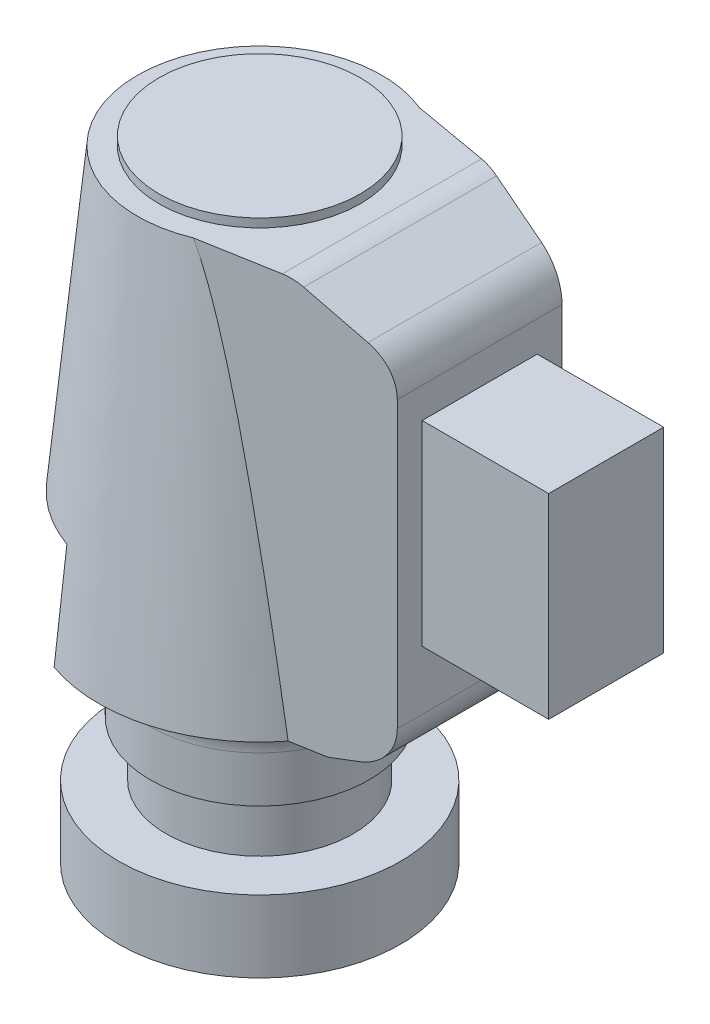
ISO-10303-21;
HEADER;
FILE_DESCRIPTION(('STEP AP214'),'2;1');
FILE_NAME('part.step','',(''),(''),'','','');
FILE_SCHEMA(('AUTOMOTIVE_DESIGN { 1 0 10303 214 1 1 1 1 }'));
ENDSEC;
DATA;
#1=APPLICATION_CONTEXT('core data for automotive mechanical design processes');
#2=APPLICATION_PROTOCOL_DEFINITION('international standard','automotive_design',2000,#1);
#3=PRODUCT_CONTEXT('',#1,'mechanical');
#4=PRODUCT('Part','Part','',(#3));
#5=PRODUCT_RELATED_PRODUCT_CATEGORY('part','',(#4));
#6=PRODUCT_DEFINITION_FORMATION('','',#4);
#7=PRODUCT_DEFINITION_CONTEXT('part definition',#1,'design');
#8=PRODUCT_DEFINITION('design','',#6,#7);
#9=PRODUCT_DEFINITION_SHAPE('','',#8);
#10=(LENGTH_UNIT() NAMED_UNIT(*) SI_UNIT(.MILLI.,.METRE.));
#11=(NAMED_UNIT(*) PLANE_ANGLE_UNIT() SI_UNIT($,.RADIAN.));
#12=(NAMED_UNIT(*) SI_UNIT($,.STERADIAN.) SOLID_ANGLE_UNIT());
#13=UNCERTAINTY_MEASURE_WITH_UNIT(LENGTH_MEASURE(1.E-05),#10,'distance_accuracy_value','');
#14=(GEOMETRIC_REPRESENTATION_CONTEXT(3) GLOBAL_UNCERTAINTY_ASSIGNED_CONTEXT((#13)) GLOBAL_UNIT_ASSIGNED_CONTEXT((#10,
#11,#12)) REPRESENTATION_CONTEXT('',''));
#15=CARTESIAN_POINT('',(0.,0.,0.));
#16=DIRECTION('',(0.,0.,1.));
#17=DIRECTION('',(1.,0.,0.));
#18=AXIS2_PLACEMENT_3D('',#15,#16,#17);
#19=CARTESIAN_POINT('',(0.,76.,0.));
#20=DIRECTION('',(0.,-1.,0.));
#21=DIRECTION('',(0.,0.,-1.));
#22=AXIS2_PLACEMENT_3D('',#19,#20,#21);
#23=CONICAL_SURFACE('',#22,56.,0.0961313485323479);
#24=CARTESIAN_POINT('',(0.,112.,0.));
#25=DIRECTION('',(0.,-1.,0.));
#26=DIRECTION('',(0.,0.,-1.));
#27=AXIS2_PLACEMENT_3D('',#24,#25,#26);
#28=CIRCLE('',#27,52.5285714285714);
#29=CARTESIAN_POINT('',(-17.5343974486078,112.,-49.5156108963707));
#30=VERTEX_POINT('',#29);
#31=CARTESIAN_POINT('',(-17.5343974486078,112.,49.5156108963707));
#32=VERTEX_POINT('',#31);
#33=EDGE_CURVE('E11',#30,#32,#28,.F.);
#34=ORIENTED_EDGE('',*,*,#33,.T.);
#35=DIRECTION('',(0.0320399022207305,0.995382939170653,-0.090477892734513));
#36=VECTOR('',#35,1.);
#37=CARTESIAN_POINT('',(0.,656.740740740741,0.));
#38=LINE('',#37,#36);
#39=CARTESIAN_POINT('',(-18.6931841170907,76.,52.7879235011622));
#40=VERTEX_POINT('',#39);
#41=EDGE_CURVE('E215',#32,#40,#38,.F.);
#42=ORIENTED_EDGE('',*,*,#41,.T.);
#43=CARTESIAN_POINT('',(0.,76.,0.));
#44=DIRECTION('',(0.,-1.,0.));
#45=DIRECTION('',(0.,0.,-1.));
#46=AXIS2_PLACEMENT_3D('',#43,#44,#45);
#47=CIRCLE('',#46,56.);
#48=CARTESIAN_POINT('',(44.2350399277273,76.,34.3403733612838));
#49=VERTEX_POINT('',#48);
#50=EDGE_CURVE('E354',#49,#40,#47,.T.);
#51=ORIENTED_EDGE('',*,*,#50,.F.);
#52=CARTESIAN_POINT('',(-41.7520721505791,-14.8322607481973,49.5022212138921));
#53=CARTESIAN_POINT('',(-41.1547216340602,-10.0036286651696,49.3968922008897));
#54=CARTESIAN_POINT('',(-40.5530175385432,-5.17554919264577,49.2907955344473));
#55=CARTESIAN_POINT('',(-39.3397049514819,4.47936158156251,49.0768557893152));
#56=CARTESIAN_POINT('',(-38.7280963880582,9.30619287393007,48.9690126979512));
#57=CARTESIAN_POINT('',(-37.4925121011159,18.9683580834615,48.7511458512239));
#58=CARTESIAN_POINT('',(-36.8685134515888,23.80368898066,48.6411180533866));
#59=CARTESIAN_POINT('',(-35.607884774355,33.4726259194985,48.4188352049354));
#60=CARTESIAN_POINT('',(-34.9712548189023,38.3062319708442,48.3065801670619));
#61=CARTESIAN_POINT('',(-33.6696431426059,48.0759633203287,48.0770709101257));
#62=CARTESIAN_POINT('',(-33.0043460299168,53.0120453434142,47.9597610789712));
#63=CARTESIAN_POINT('',(-31.6563197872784,62.8818391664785,47.7220676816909));
#64=CARTESIAN_POINT('',(-30.9735903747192,67.8155509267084,47.6016840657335));
#65=CARTESIAN_POINT('',(-29.5891240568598,77.6702435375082,47.3575653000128));
#66=CARTESIAN_POINT('',(-28.8874275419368,82.591230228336,47.2338372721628));
#67=CARTESIAN_POINT('',(-27.4600009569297,92.4293236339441,46.9821434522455));
#68=CARTESIAN_POINT('',(-26.7342722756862,97.3464305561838,46.8541779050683));
#69=CARTESIAN_POINT('',(-25.255816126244,107.162960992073,46.5934861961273));
#70=CARTESIAN_POINT('',(-24.5031664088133,112.062396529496,46.4607737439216));
#71=CARTESIAN_POINT('',(-23.3474676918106,119.407750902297,46.2569928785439));
#72=CARTESIAN_POINT('',(-22.9577373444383,121.85583268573,46.1882729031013));
#73=CARTESIAN_POINT('',(-22.168297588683,126.750335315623,46.0490733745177));
#74=CARTESIAN_POINT('',(-21.7685881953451,129.196756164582,45.9785938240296));
#75=CARTESIAN_POINT('',(-20.9554749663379,134.102453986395,45.8352200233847));
#76=CARTESIAN_POINT('',(-20.5420029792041,136.561719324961,45.7623137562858));
#77=CARTESIAN_POINT('',(-19.7021025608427,141.477964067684,45.6142166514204));
#78=CARTESIAN_POINT('',(-19.2756741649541,143.934943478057,45.539025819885));
#79=CARTESIAN_POINT('',(-18.4082429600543,148.844371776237,45.3860742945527));
#80=CARTESIAN_POINT('',(-17.9672511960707,151.296822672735,45.3083155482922));
#81=CARTESIAN_POINT('',(-17.0679752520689,156.19840893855,45.1497489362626));
#82=CARTESIAN_POINT('',(-16.6096914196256,158.647544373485,45.0689411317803));
#83=CARTESIAN_POINT('',(-15.6767631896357,163.520660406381,44.9044407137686));
#84=CARTESIAN_POINT('',(-15.2022943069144,165.944675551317,44.8207790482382));
#85=CARTESIAN_POINT('',(-14.2292812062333,170.787922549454,44.6492105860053));
#86=CARTESIAN_POINT('',(-13.7307351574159,173.207154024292,44.5613034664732));
#87=CARTESIAN_POINT('',(-12.702807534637,178.046062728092,44.3800520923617));
#88=CARTESIAN_POINT('',(-12.1733426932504,180.465721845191,44.2866931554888));
#89=CARTESIAN_POINT('',(-11.3512579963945,184.088363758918,44.1417374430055));
#90=CARTESIAN_POINT('',(-11.0726179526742,185.29462154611,44.0926056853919));
#91=CARTESIAN_POINT('',(-10.5047060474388,187.704550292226,43.9924674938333));
#92=CARTESIAN_POINT('',(-10.2154342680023,188.908221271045,43.9414610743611));
#93=CARTESIAN_POINT('',(-9.62822924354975,191.298066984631,43.8379209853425));
#94=CARTESIAN_POINT('',(-9.33044139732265,192.484278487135,43.7854129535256));
#95=CARTESIAN_POINT('',(-8.72103950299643,194.853024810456,43.6779589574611));
#96=CARTESIAN_POINT('',(-8.40942566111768,196.035559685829,43.6230130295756));
#97=CARTESIAN_POINT('',(-7.76957512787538,198.397326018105,43.5101901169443));
#98=CARTESIAN_POINT('',(-7.44132140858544,199.576552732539,43.4523101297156));
#99=CARTESIAN_POINT('',(-6.7652653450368,201.929164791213,43.3331032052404));
#100=CARTESIAN_POINT('',(-6.41746417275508,203.102550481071,43.2717764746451));
#101=CARTESIAN_POINT('',(-5.69966854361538,205.435882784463,43.1452097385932));
#102=CARTESIAN_POINT('',(-5.3297939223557,206.595867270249,43.0799908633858));
#103=CARTESIAN_POINT('',(-4.56007355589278,208.905988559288,42.9442683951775));
#104=CARTESIAN_POINT('',(-4.16022018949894,210.056122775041,42.8737634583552));
#105=CARTESIAN_POINT('',(-3.53141704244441,211.769221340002,42.7628884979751));
#106=CARTESIAN_POINT('',(-3.31717429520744,212.337756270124,42.7251117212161));
#107=CARTESIAN_POINT('',(-2.87725990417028,213.47023785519,42.6475429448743));
#108=CARTESIAN_POINT('',(-2.65158881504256,214.034184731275,42.6077510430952));
#109=CARTESIAN_POINT('',(-2.18685886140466,215.156066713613,42.5258066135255));
#110=CARTESIAN_POINT('',(-1.94780629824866,215.714004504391,42.4836551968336));
#111=CARTESIAN_POINT('',(-1.4535123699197,216.822407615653,42.3964978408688));
#112=CARTESIAN_POINT('',(-1.1982734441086,217.372874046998,42.3514923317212));
#113=CARTESIAN_POINT('',(-0.857899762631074,218.07293282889,42.2914752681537));
#114=CARTESIAN_POINT('',(-0.781927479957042,218.227138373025,42.2780793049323));
#115=CARTESIAN_POINT('',(-0.628261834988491,218.534672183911,42.2509839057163));
#116=CARTESIAN_POINT('',(-0.550568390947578,218.688000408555,42.2372844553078));
#117=CARTESIAN_POINT('',(-0.314719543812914,219.146582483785,42.1956979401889));
#118=CARTESIAN_POINT('',(-0.153817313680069,219.450388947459,42.1673265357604));
#119=CARTESIAN_POINT('',(0.176773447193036,220.053983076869,42.1090344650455));
#120=CARTESIAN_POINT('',(0.346481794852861,220.353759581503,42.0791103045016));
#121=CARTESIAN_POINT('',(0.695678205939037,220.947373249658,42.0175375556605));
#122=CARTESIAN_POINT('',(0.875165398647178,221.241210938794,41.9858891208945));
#123=CARTESIAN_POINT('',(1.24250624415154,221.816455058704,41.9211170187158));
#124=CARTESIAN_POINT('',(1.430167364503,222.097987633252,41.8880272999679));
#125=CARTESIAN_POINT('',(1.81861536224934,222.651538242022,41.819533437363));
#126=CARTESIAN_POINT('',(2.01939930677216,222.923558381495,41.7841298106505));
#127=CARTESIAN_POINT('',(2.43603283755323,223.454065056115,41.710666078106));
#128=CARTESIAN_POINT('',(2.65183100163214,223.712592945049,41.6726150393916));
#129=CARTESIAN_POINT('',(3.10213442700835,224.212122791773,41.5932143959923));
#130=CARTESIAN_POINT('',(3.33661963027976,224.453143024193,41.5518683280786));
#131=CARTESIAN_POINT('',(3.69531173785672,224.786736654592,41.4886212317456));
#132=CARTESIAN_POINT('',(3.81064807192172,224.889154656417,41.468284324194));
#133=CARTESIAN_POINT('',(4.04647166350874,225.087688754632,41.4267022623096));
#134=CARTESIAN_POINT('',(4.16695961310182,225.183803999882,41.4054569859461));
#135=CARTESIAN_POINT('',(4.53694628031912,225.461107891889,41.3402183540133));
#136=CARTESIAN_POINT('',(4.79487749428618,225.631168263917,41.294738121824));
#137=CARTESIAN_POINT('',(5.29393141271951,225.906170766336,41.2067414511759));
#138=CARTESIAN_POINT('',(5.53183442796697,226.017039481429,41.1647927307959));
#139=CARTESIAN_POINT('',(6.02236028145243,226.197492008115,41.0782997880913));
#140=CARTESIAN_POINT('',(6.27495507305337,226.267151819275,41.0337605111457));
#141=CARTESIAN_POINT('',(6.79150418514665,226.356837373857,40.9426789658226));
#142=CARTESIAN_POINT('',(7.05554712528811,226.376357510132,40.8961210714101));
#143=CARTESIAN_POINT('',(7.58211407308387,226.361126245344,40.8032731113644));
#144=CARTESIAN_POINT('',(7.84463762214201,226.326359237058,40.7569831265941));
#145=CARTESIAN_POINT('',(8.36973614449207,226.205348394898,40.6643940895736));
#146=CARTESIAN_POINT('',(8.63179948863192,226.116895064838,40.6181852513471));
#147=CARTESIAN_POINT('',(9.13836161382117,225.89807972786,40.5288646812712));
#148=CARTESIAN_POINT('',(9.38282606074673,225.767638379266,40.4857590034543));
#149=CARTESIAN_POINT('',(9.81103799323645,225.502047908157,40.410253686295));
#150=CARTESIAN_POINT('',(9.99785304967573,225.37185884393,40.3773131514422));
#151=CARTESIAN_POINT('',(10.359718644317,225.095456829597,40.3135064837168));
#152=CARTESIAN_POINT('',(10.5347605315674,224.949232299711,40.2826418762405));
#153=CARTESIAN_POINT('',(10.8744578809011,224.644182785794,40.2227440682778));
#154=CARTESIAN_POINT('',(11.0390884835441,224.48532954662,40.1937152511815));
#155=CARTESIAN_POINT('',(11.3587094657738,224.158084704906,40.1373574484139));
#156=CARTESIAN_POINT('',(11.5137026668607,223.989695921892,40.1100279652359));
#157=CARTESIAN_POINT('',(11.8910988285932,223.558774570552,40.0434828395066));
#158=CARTESIAN_POINT('',(12.1082127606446,223.291475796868,40.0051997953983));
#159=CARTESIAN_POINT('',(12.5268102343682,222.744464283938,39.9313897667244));
#160=CARTESIAN_POINT('',(12.7282850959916,222.464744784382,39.8958643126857));
#161=CARTESIAN_POINT('',(13.1184628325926,221.895558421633,39.8270654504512));
#162=CARTESIAN_POINT('',(13.3071417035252,221.606074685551,39.7937962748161));
#163=CARTESIAN_POINT('',(13.6734030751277,221.01994793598,39.7292145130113));
#164=CARTESIAN_POINT('',(13.8509841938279,220.723304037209,39.6979021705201));
#165=CARTESIAN_POINT('',(14.1976729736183,220.122620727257,39.6367715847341));
#166=CARTESIAN_POINT('',(14.3667244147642,219.818547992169,39.6069632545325));
#167=CARTESIAN_POINT('',(14.6965445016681,219.205805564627,39.5488070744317));
#168=CARTESIAN_POINT('',(14.8573128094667,218.897135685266,39.520459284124));
#169=CARTESIAN_POINT('',(15.1714239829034,218.27643077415,39.4650730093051));
#170=CARTESIAN_POINT('',(15.3247760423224,217.964400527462,39.4380329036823));
#171=CARTESIAN_POINT('',(15.6251212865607,217.337223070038,39.3850739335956));
#172=CARTESIAN_POINT('',(15.7721146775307,217.022075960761,39.3591550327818));
#173=CARTESIAN_POINT('',(16.2421362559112,215.990496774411,39.2762775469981));
#174=CARTESIAN_POINT('',(16.5536626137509,215.268649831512,39.2213470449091));
#175=CARTESIAN_POINT('',(17.1543377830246,213.81537602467,39.1154318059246));
#176=CARTESIAN_POINT('',(17.4434826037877,213.083947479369,39.0644477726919));
#177=CARTESIAN_POINT('',(18.0037668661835,211.613572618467,38.9656545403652));
#178=CARTESIAN_POINT('',(18.2748962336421,210.874622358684,38.9178471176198));
#179=CARTESIAN_POINT('',(18.8021171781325,209.391192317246,38.8248838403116));
#180=CARTESIAN_POINT('',(19.0582079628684,208.646712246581,38.7797281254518));
#181=CARTESIAN_POINT('',(19.5582931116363,207.151583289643,38.6915496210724));
#182=CARTESIAN_POINT('',(19.802256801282,206.400923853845,38.6485322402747));
#183=CARTESIAN_POINT('',(20.2792433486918,204.896022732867,38.5644266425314));
#184=CARTESIAN_POINT('',(20.5122659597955,204.141780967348,38.5233384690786));
#185=CARTESIAN_POINT('',(21.1969975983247,201.875174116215,38.4026018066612));
#186=CARTESIAN_POINT('',(21.63454636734,200.35839379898,38.3254501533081));
#187=CARTESIAN_POINT('',(22.4803060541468,197.316565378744,38.1763199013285));
#188=CARTESIAN_POINT('',(22.8885181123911,195.791517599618,38.1043411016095));
#189=CARTESIAN_POINT('',(23.6813537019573,192.735006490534,37.9645427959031));
#190=CARTESIAN_POINT('',(24.0659754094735,191.203542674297,37.8967236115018));
#191=CARTESIAN_POINT('',(24.8151808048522,188.138017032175,37.7646184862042));
#192=CARTESIAN_POINT('',(25.1797935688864,186.603962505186,37.7003274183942));
#193=CARTESIAN_POINT('',(25.8926646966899,183.531999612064,37.5746290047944));
#194=CARTESIAN_POINT('',(26.2409235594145,181.994091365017,37.5132215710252));
#195=CARTESIAN_POINT('',(26.9203841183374,178.92900386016,37.3934143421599));
#196=CARTESIAN_POINT('',(27.2517115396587,177.401853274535,37.3349923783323));
#197=CARTESIAN_POINT('',(27.9024654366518,174.344935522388,37.2202469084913));
#198=CARTESIAN_POINT('',(28.2218918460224,172.815168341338,37.1639234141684));
#199=CARTESIAN_POINT('',(28.8503180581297,169.753385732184,37.0531149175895));
#200=CARTESIAN_POINT('',(29.1593175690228,168.221370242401,36.9986299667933));
#201=CARTESIAN_POINT('',(29.7680732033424,165.155444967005,36.8912899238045));
#202=CARTESIAN_POINT('',(30.0678292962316,163.62153517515,36.8384348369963));
#203=CARTESIAN_POINT('',(30.954835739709,159.017008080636,36.682031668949));
#204=CARTESIAN_POINT('',(31.5297538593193,155.943938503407,36.5806580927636));
#205=CARTESIAN_POINT('',(32.6529330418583,149.792781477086,36.3826112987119));
#206=CARTESIAN_POINT('',(33.2011939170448,146.714693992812,36.2859381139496));
#207=CARTESIAN_POINT('',(34.007195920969,142.093130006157,36.1438182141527));
#208=CARTESIAN_POINT('',(34.2732531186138,140.551142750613,36.0969051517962));
#209=CARTESIAN_POINT('',(34.8002536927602,137.466275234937,36.0039807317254));
#210=CARTESIAN_POINT('',(35.0611970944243,135.923394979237,35.9579693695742));
#211=CARTESIAN_POINT('',(35.8369857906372,131.29352374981,35.8211768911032));
#212=CARTESIAN_POINT('',(36.3447874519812,128.205314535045,35.7316377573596));
#213=CARTESIAN_POINT('',(37.3442727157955,122.026435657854,35.5554015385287));
#214=CARTESIAN_POINT('',(37.8359574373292,118.935766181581,35.4687042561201));
#215=CARTESIAN_POINT('',(38.8053717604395,112.752177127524,35.2977703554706));
#216=CARTESIAN_POINT('',(39.2831013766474,109.659257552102,35.2135337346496));
#217=CARTESIAN_POINT('',(40.2256189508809,103.47621104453,35.0473424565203));
#218=CARTESIAN_POINT('',(40.6904255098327,100.386087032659,34.9653845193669));
#219=CARTESIAN_POINT('',(41.6092576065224,94.2041855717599,34.8033696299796));
#220=CARTESIAN_POINT('',(42.0632831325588,91.1124081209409,34.723312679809));
#221=CARTESIAN_POINT('',(43.4110203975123,81.8348351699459,34.4856702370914));
#222=CARTESIAN_POINT('',(44.2903793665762,75.646887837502,34.3306155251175));
#223=CARTESIAN_POINT('',(46.0179102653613,63.2687202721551,34.0260052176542));
#224=CARTESIAN_POINT('',(46.866092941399,57.0785015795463,33.8764477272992));
#225=CARTESIAN_POINT('',(48.536948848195,44.6945521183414,33.5818307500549));
#226=CARTESIAN_POINT('',(49.3596222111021,38.5008213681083,33.4367712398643));
#227=CARTESIAN_POINT('',(50.6860891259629,28.3800246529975,33.2028793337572));
#228=CARTESIAN_POINT('',(51.1962936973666,24.4538226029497,33.1129165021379));
#229=CARTESIAN_POINT('',(52.2089641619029,16.6001403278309,32.9343553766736));
#230=CARTESIAN_POINT('',(52.7114295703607,12.6726600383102,32.8457571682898));
#231=CARTESIAN_POINT('',(53.7094334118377,4.81595738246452,32.6697821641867));
#232=CARTESIAN_POINT('',(54.2049703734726,0.886734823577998,32.5824056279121));
#233=CARTESIAN_POINT('',(55.1895950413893,-6.97228913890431,32.4087897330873));
#234=CARTESIAN_POINT('',(55.678683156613,-10.9020904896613,32.3225503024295));
#235=CARTESIAN_POINT('',(56.1648708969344,-14.8322607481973,32.2368222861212));
#236=B_SPLINE_CURVE_WITH_KNOTS('',3,(#52,#53,#54,#55,#56,#57,#58,#59,#60,#61,#62,#63,#64,#65,
#66,#67,#68,#69,#70,#71,#72,#73,#74,#75,#76,#77,#78,#79,#80,#81,#82,#83,#84,#85,#86,#87,#88,#89,
#90,#91,#92,#93,#94,#95,#96,#97,#98,#99,#100,#101,#102,#103,#104,#105,#106,#107,#108,#109,#110,
#111,#112,#113,#114,#115,#116,#117,#118,#119,#120,#121,#122,#123,#124,#125,#126,#127,#128,#129,
#130,#131,#132,#133,#134,#135,#136,#137,#138,#139,#140,#141,#142,#143,#144,#145,#146,#147,#148,
#149,#150,#151,#152,#153,#154,#155,#156,#157,#158,#159,#160,#161,#162,#163,#164,#165,#166,#167,
#168,#169,#170,#171,#172,#173,#174,#175,#176,#177,#178,#179,#180,#181,#182,#183,#184,#185,#186,
#187,#188,#189,#190,#191,#192,#193,#194,#195,#196,#197,#198,#199,#200,#201,#202,#203,#204,#205,
#206,#207,#208,#209,#210,#211,#212,#213,#214,#215,#216,#217,#218,#219,#220,#221,#222,#223,#224,
#225,#226,#227,#228,#229,#230,#231,#232,#233,#234,#235),.UNSPECIFIED.,.F.,.F.,(4,2,2,2,2,2,2,2,
2,2,2,2,2,2,2,2,2,2,2,2,2,2,2,2,2,2,2,2,2,2,2,2,2,2,2,2,2,2,2,2,2,2,2,2,2,2,2,2,2,2,2,2,2,2,2,2,
2,2,2,2,2,2,2,2,2,2,2,2,2,2,2,2,2,2,2,2,2,2,2,2,2,2,2,2,2,2,2,2,2,2,2,4),(0.,14.5997446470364,
29.1995952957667,43.8295884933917,58.459498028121,73.4057605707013,88.3522655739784,
103.269122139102,118.185118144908,133.061051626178,140.500621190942,147.940179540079,
155.424688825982,162.909177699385,170.388115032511,177.866902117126,185.281088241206,
192.695839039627,200.131572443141,203.848522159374,207.565443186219,211.237807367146,
214.910116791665,218.586263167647,222.262189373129,225.919711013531,229.578165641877,
231.404273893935,233.230293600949,235.055460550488,236.880353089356,237.397621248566,
237.914914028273,238.949649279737,239.98682359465,241.02390570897,242.043470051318,
243.06280730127,244.078810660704,245.09373779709,245.56028522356,246.026895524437,
246.960492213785,247.755016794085,248.548071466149,249.349092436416,250.150343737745,
250.987045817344,251.825338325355,252.514592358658,253.204347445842,253.895691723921,
254.586832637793,255.625472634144,256.66468503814,257.705795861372,258.747036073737,
259.794424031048,260.841854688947,261.887951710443,262.934014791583,265.297788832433,
267.661983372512,270.027489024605,272.393119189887,274.764456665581,277.13584757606,
281.876941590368,286.61785119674,291.359126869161,296.093319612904,300.827367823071,
305.518625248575,310.209908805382,314.901323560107,319.592753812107,328.97667254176,
338.360657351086,343.057074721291,347.753468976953,357.146294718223,366.538466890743,
375.93062921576,385.308488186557,394.686357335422,413.44236506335,432.191845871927,
450.941229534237,462.821928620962,474.703368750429,486.587294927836,498.470463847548),.UNSPECIFIED.);
#237=CARTESIAN_POINT('',(16.2323115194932,216.,39.278009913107));
#238=VERTEX_POINT('',#237);
#239=EDGE_CURVE('E323',#238,#49,#236,.T.);
#240=ORIENTED_EDGE('',*,*,#239,.F.);
#241=CARTESIAN_POINT('',(0.,216.,0.));
#242=DIRECTION('',(0.,-1.,0.));
#243=DIRECTION('',(0.,0.,-1.));
#244=AXIS2_PLACEMENT_3D('',#241,#242,#243);
#245=CIRCLE('',#244,42.5);
#246=CARTESIAN_POINT('',(16.2323115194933,216.,-39.2780099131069));
#247=VERTEX_POINT('',#246);
#248=EDGE_CURVE('E357',#238,#247,#245,.T.);
#249=ORIENTED_EDGE('',*,*,#248,.T.);
#250=CARTESIAN_POINT('',(-41.7520721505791,-14.8322607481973,-49.5022212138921));
#251=CARTESIAN_POINT('',(-41.1547216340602,-10.0036286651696,-49.3968922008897));
#252=CARTESIAN_POINT('',(-40.5530175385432,-5.17554919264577,-49.2907955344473));
#253=CARTESIAN_POINT('',(-39.3397049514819,4.47936158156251,-49.0768557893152));
#254=CARTESIAN_POINT('',(-38.7280963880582,9.30619287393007,-48.9690126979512));
#255=CARTESIAN_POINT('',(-37.4925121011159,18.9683580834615,-48.7511458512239));
#256=CARTESIAN_POINT('',(-36.8685134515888,23.80368898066,-48.6411180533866));
#257=CARTESIAN_POINT('',(-35.607884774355,33.4726259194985,-48.4188352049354));
#258=CARTESIAN_POINT('',(-34.9712548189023,38.3062319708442,-48.3065801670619));
#259=CARTESIAN_POINT('',(-33.6696431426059,48.0759633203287,-48.0770709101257));
#260=CARTESIAN_POINT('',(-33.0043460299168,53.0120453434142,-47.9597610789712));
#261=CARTESIAN_POINT('',(-31.6563197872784,62.8818391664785,-47.7220676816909));
#262=CARTESIAN_POINT('',(-30.9735903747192,67.8155509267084,-47.6016840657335));
#263=CARTESIAN_POINT('',(-29.5891240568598,77.6702435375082,-47.3575653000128));
#264=CARTESIAN_POINT('',(-28.8874275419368,82.591230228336,-47.2338372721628));
#265=CARTESIAN_POINT('',(-27.4600009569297,92.4293236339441,-46.9821434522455));
#266=CARTESIAN_POINT('',(-26.7342722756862,97.3464305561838,-46.8541779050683));
#267=CARTESIAN_POINT('',(-25.255816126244,107.162960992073,-46.5934861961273));
#268=CARTESIAN_POINT('',(-24.5031664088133,112.062396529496,-46.4607737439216));
#269=CARTESIAN_POINT('',(-23.3474676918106,119.407750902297,-46.2569928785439));
#270=CARTESIAN_POINT('',(-22.9577373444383,121.85583268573,-46.1882729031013));
#271=CARTESIAN_POINT('',(-22.168297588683,126.750335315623,-46.0490733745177));
#272=CARTESIAN_POINT('',(-21.7685881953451,129.196756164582,-45.9785938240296));
#273=CARTESIAN_POINT('',(-20.9554749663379,134.102453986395,-45.8352200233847));
#274=CARTESIAN_POINT('',(-20.5420029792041,136.561719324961,-45.7623137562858));
#275=CARTESIAN_POINT('',(-19.7021025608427,141.477964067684,-45.6142166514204));
#276=CARTESIAN_POINT('',(-19.2756741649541,143.934943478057,-45.539025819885));
#277=CARTESIAN_POINT('',(-18.4082429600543,148.844371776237,-45.3860742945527));
#278=CARTESIAN_POINT('',(-17.9672511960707,151.296822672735,-45.3083155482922));
#279=CARTESIAN_POINT('',(-17.0679752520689,156.19840893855,-45.1497489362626));
#280=CARTESIAN_POINT('',(-16.6096914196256,158.647544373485,-45.0689411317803));
#281=CARTESIAN_POINT('',(-15.6767631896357,163.520660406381,-44.9044407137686));
#282=CARTESIAN_POINT('',(-15.2022943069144,165.944675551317,-44.8207790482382));
#283=CARTESIAN_POINT('',(-14.2292812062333,170.787922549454,-44.6492105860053));
#284=CARTESIAN_POINT('',(-13.7307351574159,173.207154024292,-44.5613034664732));
#285=CARTESIAN_POINT('',(-12.702807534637,178.046062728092,-44.3800520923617));
#286=CARTESIAN_POINT('',(-12.1733426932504,180.465721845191,-44.2866931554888));
#287=CARTESIAN_POINT('',(-11.3512579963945,184.088363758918,-44.1417374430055));
#288=CARTESIAN_POINT('',(-11.0726179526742,185.29462154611,-44.0926056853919));
#289=CARTESIAN_POINT('',(-10.5047060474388,187.704550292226,-43.9924674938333));
#290=CARTESIAN_POINT('',(-10.2154342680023,188.908221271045,-43.9414610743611));
#291=CARTESIAN_POINT('',(-9.62822924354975,191.298066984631,-43.8379209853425));
#292=CARTESIAN_POINT('',(-9.33044139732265,192.484278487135,-43.7854129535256));
#293=CARTESIAN_POINT('',(-8.72103950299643,194.853024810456,-43.6779589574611));
#294=CARTESIAN_POINT('',(-8.40942566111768,196.035559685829,-43.6230130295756));
#295=CARTESIAN_POINT('',(-7.76957512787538,198.397326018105,-43.5101901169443));
#296=CARTESIAN_POINT('',(-7.44132140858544,199.576552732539,-43.4523101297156));
#297=CARTESIAN_POINT('',(-6.7652653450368,201.929164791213,-43.3331032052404));
#298=CARTESIAN_POINT('',(-6.41746417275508,203.102550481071,-43.2717764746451));
#299=CARTESIAN_POINT('',(-5.69966854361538,205.435882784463,-43.1452097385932));
#300=CARTESIAN_POINT('',(-5.3297939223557,206.595867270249,-43.0799908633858));
#301=CARTESIAN_POINT('',(-4.56007355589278,208.905988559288,-42.9442683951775));
#302=CARTESIAN_POINT('',(-4.16022018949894,210.056122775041,-42.8737634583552));
#303=CARTESIAN_POINT('',(-3.53141704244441,211.769221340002,-42.7628884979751));
#304=CARTESIAN_POINT('',(-3.31717429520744,212.337756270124,-42.7251117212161));
#305=CARTESIAN_POINT('',(-2.87725990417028,213.47023785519,-42.6475429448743));
#306=CARTESIAN_POINT('',(-2.65158881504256,214.034184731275,-42.6077510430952));
#307=CARTESIAN_POINT('',(-2.18685886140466,215.156066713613,-42.5258066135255));
#308=CARTESIAN_POINT('',(-1.94780629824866,215.714004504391,-42.4836551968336));
#309=CARTESIAN_POINT('',(-1.4535123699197,216.822407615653,-42.3964978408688));
#310=CARTESIAN_POINT('',(-1.1982734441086,217.372874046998,-42.3514923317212));
#311=CARTESIAN_POINT('',(-0.857899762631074,218.07293282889,-42.2914752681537));
#312=CARTESIAN_POINT('',(-0.781927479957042,218.227138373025,-42.2780793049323));
#313=CARTESIAN_POINT('',(-0.628261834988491,218.534672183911,-42.2509839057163));
#314=CARTESIAN_POINT('',(-0.550568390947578,218.688000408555,-42.2372844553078));
#315=CARTESIAN_POINT('',(-0.314719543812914,219.146582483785,-42.1956979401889));
#316=CARTESIAN_POINT('',(-0.153817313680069,219.450388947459,-42.1673265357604));
#317=CARTESIAN_POINT('',(0.176773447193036,220.053983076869,-42.1090344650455));
#318=CARTESIAN_POINT('',(0.346481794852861,220.353759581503,-42.0791103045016));
#319=CARTESIAN_POINT('',(0.695678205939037,220.947373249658,-42.0175375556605));
#320=CARTESIAN_POINT('',(0.875165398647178,221.241210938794,-41.9858891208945));
#321=CARTESIAN_POINT('',(1.24250624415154,221.816455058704,-41.9211170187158));
#322=CARTESIAN_POINT('',(1.430167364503,222.097987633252,-41.8880272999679));
#323=CARTESIAN_POINT('',(1.81861536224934,222.651538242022,-41.819533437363));
#324=CARTESIAN_POINT('',(2.01939930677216,222.923558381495,-41.7841298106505));
#325=CARTESIAN_POINT('',(2.43603283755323,223.454065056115,-41.710666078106));
#326=CARTESIAN_POINT('',(2.65183100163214,223.712592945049,-41.6726150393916));
#327=CARTESIAN_POINT('',(3.10213442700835,224.212122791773,-41.5932143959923));
#328=CARTESIAN_POINT('',(3.33661963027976,224.453143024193,-41.5518683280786));
#329=CARTESIAN_POINT('',(3.69531173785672,224.786736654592,-41.4886212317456));
#330=CARTESIAN_POINT('',(3.81064807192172,224.889154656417,-41.468284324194));
#331=CARTESIAN_POINT('',(4.04647166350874,225.087688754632,-41.4267022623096));
#332=CARTESIAN_POINT('',(4.16695961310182,225.183803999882,-41.4054569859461));
#333=CARTESIAN_POINT('',(4.53694628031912,225.461107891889,-41.3402183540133));
#334=CARTESIAN_POINT('',(4.79487749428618,225.631168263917,-41.294738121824));
#335=CARTESIAN_POINT('',(5.29393141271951,225.906170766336,-41.2067414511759));
#336=CARTESIAN_POINT('',(5.53183442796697,226.017039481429,-41.1647927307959));
#337=CARTESIAN_POINT('',(6.02236028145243,226.197492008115,-41.0782997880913));
#338=CARTESIAN_POINT('',(6.27495507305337,226.267151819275,-41.0337605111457));
#339=CARTESIAN_POINT('',(6.79150418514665,226.356837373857,-40.9426789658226));
#340=CARTESIAN_POINT('',(7.05554712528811,226.376357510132,-40.8961210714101));
#341=CARTESIAN_POINT('',(7.58211407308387,226.361126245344,-40.8032731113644));
#342=CARTESIAN_POINT('',(7.84463762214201,226.326359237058,-40.7569831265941));
#343=CARTESIAN_POINT('',(8.36973614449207,226.205348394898,-40.6643940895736));
#344=CARTESIAN_POINT('',(8.63179948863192,226.116895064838,-40.6181852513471));
#345=CARTESIAN_POINT('',(9.13836161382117,225.89807972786,-40.5288646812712));
#346=CARTESIAN_POINT('',(9.38282606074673,225.767638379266,-40.4857590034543));
#347=CARTESIAN_POINT('',(9.81103799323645,225.502047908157,-40.410253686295));
#348=CARTESIAN_POINT('',(9.99785304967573,225.37185884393,-40.3773131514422));
#349=CARTESIAN_POINT('',(10.359718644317,225.095456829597,-40.3135064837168));
#350=CARTESIAN_POINT('',(10.5347605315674,224.949232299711,-40.2826418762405));
#351=CARTESIAN_POINT('',(10.8744578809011,224.644182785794,-40.2227440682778));
#352=CARTESIAN_POINT('',(11.0390884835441,224.48532954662,-40.1937152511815));
#353=CARTESIAN_POINT('',(11.3587094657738,224.158084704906,-40.1373574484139));
#354=CARTESIAN_POINT('',(11.5137026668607,223.989695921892,-40.1100279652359));
#355=CARTESIAN_POINT('',(11.8910988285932,223.558774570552,-40.0434828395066));
#356=CARTESIAN_POINT('',(12.1082127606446,223.291475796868,-40.0051997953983));
#357=CARTESIAN_POINT('',(12.5268102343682,222.744464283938,-39.9313897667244));
#358=CARTESIAN_POINT('',(12.7282850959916,222.464744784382,-39.8958643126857));
#359=CARTESIAN_POINT('',(13.1184628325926,221.895558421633,-39.8270654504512));
#360=CARTESIAN_POINT('',(13.3071417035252,221.606074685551,-39.7937962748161));
#361=CARTESIAN_POINT('',(13.6734030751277,221.01994793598,-39.7292145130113));
#362=CARTESIAN_POINT('',(13.8509841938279,220.723304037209,-39.6979021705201));
#363=CARTESIAN_POINT('',(14.1976729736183,220.122620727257,-39.6367715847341));
#364=CARTESIAN_POINT('',(14.3667244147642,219.818547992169,-39.6069632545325));
#365=CARTESIAN_POINT('',(14.6965445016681,219.205805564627,-39.5488070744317));
#366=CARTESIAN_POINT('',(14.8573128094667,218.897135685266,-39.520459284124));
#367=CARTESIAN_POINT('',(15.1714239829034,218.27643077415,-39.4650730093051));
#368=CARTESIAN_POINT('',(15.3247760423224,217.964400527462,-39.4380329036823));
#369=CARTESIAN_POINT('',(15.6251212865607,217.337223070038,-39.3850739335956));
#370=CARTESIAN_POINT('',(15.7721146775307,217.022075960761,-39.3591550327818));
#371=CARTESIAN_POINT('',(16.2421362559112,215.990496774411,-39.2762775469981));
#372=CARTESIAN_POINT('',(16.5536626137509,215.268649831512,-39.2213470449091));
#373=CARTESIAN_POINT('',(17.1543377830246,213.81537602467,-39.1154318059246));
#374=CARTESIAN_POINT('',(17.4434826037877,213.083947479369,-39.0644477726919));
#375=CARTESIAN_POINT('',(18.0037668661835,211.613572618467,-38.9656545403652));
#376=CARTESIAN_POINT('',(18.2748962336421,210.874622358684,-38.9178471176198));
#377=CARTESIAN_POINT('',(18.8021171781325,209.391192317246,-38.8248838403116));
#378=CARTESIAN_POINT('',(19.0582079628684,208.646712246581,-38.7797281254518));
#379=CARTESIAN_POINT('',(19.5582931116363,207.151583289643,-38.6915496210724));
#380=CARTESIAN_POINT('',(19.802256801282,206.400923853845,-38.6485322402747));
#381=CARTESIAN_POINT('',(20.2792433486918,204.896022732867,-38.5644266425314));
#382=CARTESIAN_POINT('',(20.5122659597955,204.141780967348,-38.5233384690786));
#383=CARTESIAN_POINT('',(21.1969975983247,201.875174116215,-38.4026018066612));
#384=CARTESIAN_POINT('',(21.63454636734,200.35839379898,-38.3254501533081));
#385=CARTESIAN_POINT('',(22.4803060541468,197.316565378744,-38.1763199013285));
#386=CARTESIAN_POINT('',(22.8885181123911,195.791517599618,-38.1043411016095));
#387=CARTESIAN_POINT('',(23.6813537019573,192.735006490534,-37.9645427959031));
#388=CARTESIAN_POINT('',(24.0659754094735,191.203542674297,-37.8967236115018));
#389=CARTESIAN_POINT('',(24.8151808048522,188.138017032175,-37.7646184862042));
#390=CARTESIAN_POINT('',(25.1797935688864,186.603962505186,-37.7003274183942));
#391=CARTESIAN_POINT('',(25.8926646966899,183.531999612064,-37.5746290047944));
#392=CARTESIAN_POINT('',(26.2409235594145,181.994091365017,-37.5132215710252));
#393=CARTESIAN_POINT('',(26.9203841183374,178.92900386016,-37.3934143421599));
#394=CARTESIAN_POINT('',(27.2517115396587,177.401853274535,-37.3349923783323));
#395=CARTESIAN_POINT('',(27.9024654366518,174.344935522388,-37.2202469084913));
#396=CARTESIAN_POINT('',(28.2218918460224,172.815168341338,-37.1639234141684));
#397=CARTESIAN_POINT('',(28.8503180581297,169.753385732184,-37.0531149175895));
#398=CARTESIAN_POINT('',(29.1593175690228,168.221370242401,-36.9986299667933));
#399=CARTESIAN_POINT('',(29.7680732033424,165.155444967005,-36.8912899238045));
#400=CARTESIAN_POINT('',(30.0678292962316,163.62153517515,-36.8384348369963));
#401=CARTESIAN_POINT('',(30.954835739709,159.017008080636,-36.682031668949));
#402=CARTESIAN_POINT('',(31.5297538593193,155.943938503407,-36.5806580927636));
#403=CARTESIAN_POINT('',(32.6529330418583,149.792781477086,-36.3826112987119));
#404=CARTESIAN_POINT('',(33.2011939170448,146.714693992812,-36.2859381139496));
#405=CARTESIAN_POINT('',(34.007195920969,142.093130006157,-36.1438182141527));
#406=CARTESIAN_POINT('',(34.2732531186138,140.551142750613,-36.0969051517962));
#407=CARTESIAN_POINT('',(34.8002536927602,137.466275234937,-36.0039807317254));
#408=CARTESIAN_POINT('',(35.0611970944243,135.923394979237,-35.9579693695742));
#409=CARTESIAN_POINT('',(35.8369857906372,131.29352374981,-35.8211768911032));
#410=CARTESIAN_POINT('',(36.3447874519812,128.205314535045,-35.7316377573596));
#411=CARTESIAN_POINT('',(37.3442727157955,122.026435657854,-35.5554015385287));
#412=CARTESIAN_POINT('',(37.8359574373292,118.935766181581,-35.4687042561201));
#413=CARTESIAN_POINT('',(38.8053717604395,112.752177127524,-35.2977703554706));
#414=CARTESIAN_POINT('',(39.2831013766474,109.659257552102,-35.2135337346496));
#415=CARTESIAN_POINT('',(40.2256189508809,103.47621104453,-35.0473424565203));
#416=CARTESIAN_POINT('',(40.6904255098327,100.386087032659,-34.9653845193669));
#417=CARTESIAN_POINT('',(41.6092576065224,94.2041855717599,-34.8033696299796));
#418=CARTESIAN_POINT('',(42.0632831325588,91.1124081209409,-34.723312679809));
#419=CARTESIAN_POINT('',(43.4110203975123,81.8348351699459,-34.4856702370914));
#420=CARTESIAN_POINT('',(44.2903793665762,75.646887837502,-34.3306155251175));
#421=CARTESIAN_POINT('',(46.0179102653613,63.2687202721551,-34.0260052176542));
#422=CARTESIAN_POINT('',(46.866092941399,57.0785015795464,-33.8764477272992));
#423=CARTESIAN_POINT('',(48.536948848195,44.6945521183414,-33.5818307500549));
#424=CARTESIAN_POINT('',(49.3596222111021,38.5008213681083,-33.4367712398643));
#425=CARTESIAN_POINT('',(50.6860891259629,28.3800246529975,-33.2028793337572));
#426=CARTESIAN_POINT('',(51.1962936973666,24.4538226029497,-33.1129165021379));
#427=CARTESIAN_POINT('',(52.2089641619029,16.6001403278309,-32.9343553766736));
#428=CARTESIAN_POINT('',(52.7114295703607,12.6726600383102,-32.8457571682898));
#429=CARTESIAN_POINT('',(53.7094334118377,4.81595738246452,-32.6697821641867));
#430=CARTESIAN_POINT('',(54.2049703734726,0.88673482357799,-32.5824056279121));
#431=CARTESIAN_POINT('',(55.1895950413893,-6.97228913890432,-32.4087897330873));
#432=CARTESIAN_POINT('',(55.678683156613,-10.9020904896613,-32.3225503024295));
#433=CARTESIAN_POINT('',(56.1648708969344,-14.8322607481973,-32.2368222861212));
#434=B_SPLINE_CURVE_WITH_KNOTS('',3,(#250,#251,#252,#253,#254,#255,#256,#257,#258,#259,#260,
#261,#262,#263,#264,#265,#266,#267,#268,#269,#270,#271,#272,#273,#274,#275,#276,#277,#278,#279,
#280,#281,#282,#283,#284,#285,#286,#287,#288,#289,#290,#291,#292,#293,#294,#295,#296,#297,#298,
#299,#300,#301,#302,#303,#304,#305,#306,#307,#308,#309,#310,#311,#312,#313,#314,#315,#316,#317,
#318,#319,#320,#321,#322,#323,#324,#325,#326,#327,#328,#329,#330,#331,#332,#333,#334,#335,#336,
#337,#338,#339,#340,#341,#342,#343,#344,#345,#346,#347,#348,#349,#350,#351,#352,#353,#354,#355,
#356,#357,#358,#359,#360,#361,#362,#363,#364,#365,#366,#367,#368,#369,#370,#371,#372,#373,#374,
#375,#376,#377,#378,#379,#380,#381,#382,#383,#384,#385,#386,#387,#388,#389,#390,#391,#392,#393,
#394,#395,#396,#397,#398,#399,#400,#401,#402,#403,#404,#405,#406,#407,#408,#409,#410,#411,#412,
#413,#414,#415,#416,#417,#418,#419,#420,#421,#422,#423,#424,#425,#426,#427,#428,#429,#430,#431,
#432,#433),.UNSPECIFIED.,.F.,.F.,(4,2,2,2,2,2,2,2,2,2,2,2,2,2,2,2,2,2,2,2,2,2,2,2,2,2,2,2,2,2,2,
2,2,2,2,2,2,2,2,2,2,2,2,2,2,2,2,2,2,2,2,2,2,2,2,2,2,2,2,2,2,2,2,2,2,2,2,2,2,2,2,2,2,2,2,2,2,2,2,
2,2,2,2,2,2,2,2,2,2,2,2,4),(0.,14.5997446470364,29.1995952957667,43.8295884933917,
58.459498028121,73.4057605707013,88.3522655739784,103.269122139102,118.185118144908,
133.061051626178,140.500621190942,147.940179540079,155.424688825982,162.909177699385,
170.388115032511,177.866902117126,185.281088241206,192.695839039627,200.131572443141,
203.848522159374,207.565443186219,211.237807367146,214.910116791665,218.586263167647,
222.262189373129,225.919711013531,229.578165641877,231.404273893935,233.230293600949,
235.055460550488,236.880353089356,237.397621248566,237.914914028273,238.949649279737,
239.98682359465,241.02390570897,242.043470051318,243.06280730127,244.078810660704,
245.09373779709,245.56028522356,246.026895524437,246.960492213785,247.755016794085,
248.548071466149,249.349092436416,250.150343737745,250.987045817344,251.825338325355,
252.514592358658,253.204347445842,253.895691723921,254.586832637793,255.625472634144,
256.66468503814,257.705795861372,258.747036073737,259.794424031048,260.841854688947,
261.887951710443,262.934014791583,265.297788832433,267.661983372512,270.027489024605,
272.393119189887,274.764456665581,277.13584757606,281.876941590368,286.61785119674,
291.359126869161,296.093319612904,300.827367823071,305.518625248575,310.209908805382,
314.901323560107,319.592753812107,328.97667254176,338.360657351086,343.057074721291,
347.753468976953,357.146294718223,366.538466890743,375.93062921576,385.308488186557,
394.686357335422,413.44236506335,432.191845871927,450.941229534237,462.821928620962,
474.703368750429,486.587294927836,498.470463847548),.UNSPECIFIED.);
#435=CARTESIAN_POINT('',(44.2350399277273,76.,-34.3403733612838));
#436=VERTEX_POINT('',#435);
#437=EDGE_CURVE('E270',#247,#436,#434,.T.);
#438=ORIENTED_EDGE('',*,*,#437,.T.);
#439=CARTESIAN_POINT('',(-18.6931841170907,76.,-52.7879235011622));
#440=VERTEX_POINT('',#439);
#441=EDGE_CURVE('E353',#440,#436,#47,.T.);
#442=ORIENTED_EDGE('',*,*,#441,.F.);
#443=DIRECTION('',(0.0320399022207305,0.995382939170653,0.090477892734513));
#444=VECTOR('',#443,1.);
#445=CARTESIAN_POINT('',(0.,656.740740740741,0.));
#446=LINE('',#445,#444);
#447=EDGE_CURVE('E210',#30,#440,#446,.F.);
#448=ORIENTED_EDGE('',*,*,#447,.F.);
#449=EDGE_LOOP('',(#34,#42,#51,#240,#249,#438,#442,#448));
#450=FACE_BOUND('',#449,.T.);
#451=ADVANCED_FACE('F32',(#450),#23,.T.);
#452=CARTESIAN_POINT('',(54.0000000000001,76.,0.));
#453=DIRECTION('',(0.,-1.,0.));
#454=DIRECTION('',(0.,0.,-1.));
#455=AXIS2_PLACEMENT_3D('',#452,#453,#454);
#456=PLANE('',#455);
#457=ORIENTED_EDGE('',*,*,#50,.T.);
#458=DIRECTION('',(0.333806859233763,0.,-0.942641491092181));
#459=VECTOR('',#458,1.);
#460=CARTESIAN_POINT('',(6.0170590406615,76.,-16.9916505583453));
#461=LINE('',#460,#459);
#462=CARTESIAN_POINT('',(-18.0255703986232,76.,50.9026405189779));
#463=VERTEX_POINT('',#462);
#464=EDGE_CURVE('E212',#40,#463,#461,.T.);
#465=ORIENTED_EDGE('',*,*,#464,.T.);
#466=CARTESIAN_POINT('',(0.,76.,0.));
#467=DIRECTION('',(0.,-1.,0.));
#468=DIRECTION('',(0.,0.,-1.));
#469=AXIS2_PLACEMENT_3D('',#466,#467,#468);
#470=CIRCLE('',#469,54.0000000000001);
#471=CARTESIAN_POINT('',(-18.0255703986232,76.,-50.9026405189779));
#472=VERTEX_POINT('',#471);
#473=EDGE_CURVE('E350',#472,#463,#470,.T.);
#474=ORIENTED_EDGE('',*,*,#473,.F.);
#475=DIRECTION('',(0.333806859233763,0.,0.942641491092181));
#476=VECTOR('',#475,1.);
#477=CARTESIAN_POINT('',(6.0170590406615,76.,16.9916505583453));
#478=LINE('',#477,#476);
#479=EDGE_CURVE('E47',#440,#472,#478,.T.);
#480=ORIENTED_EDGE('',*,*,#479,.F.);
#481=ORIENTED_EDGE('',*,*,#441,.T.);
#482=DIRECTION('',(-0.984807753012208,0.,-0.173648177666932));
#483=VECTOR('',#482,1.);
#484=CARTESIAN_POINT('',(-26.3395985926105,76.,-46.7845862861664));
#485=LINE('',#484,#483);
#486=CARTESIAN_POINT('',(56.,76.,-32.2658934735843));
#487=VERTEX_POINT('',#486);
#488=EDGE_CURVE('E252',#487,#436,#485,.T.);
#489=ORIENTED_EDGE('',*,*,#488,.F.);
#490=DIRECTION('',(0.,0.,-1.));
#491=VECTOR('',#490,1.);
#492=CARTESIAN_POINT('',(56.,76.,196.163872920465));
#493=LINE('',#492,#491);
#494=CARTESIAN_POINT('',(56.,76.,32.2658934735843));
#495=VERTEX_POINT('',#494);
#496=EDGE_CURVE('E278',#495,#487,#493,.T.);
#497=ORIENTED_EDGE('',*,*,#496,.F.);
#498=DIRECTION('',(0.984807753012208,0.,-0.173648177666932));
#499=VECTOR('',#498,1.);
#500=CARTESIAN_POINT('',(27.9717947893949,76.,37.2080222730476));
#501=LINE('',#500,#499);
#502=EDGE_CURVE('E379',#49,#495,#501,.T.);
#503=ORIENTED_EDGE('',*,*,#502,.F.);
#504=EDGE_LOOP('',(#457,#465,#474,#480,#481,#489,#497,#503));
#505=FACE_BOUND('',#504,.T.);
#506=ADVANCED_FACE('F376',(#505),#456,.T.);
#507=CARTESIAN_POINT('',(0.,60.,0.));
#508=DIRECTION('',(0.,-1.,0.));
#509=DIRECTION('',(0.,0.,-1.));
#510=AXIS2_PLACEMENT_3D('',#507,#508,#509);
#511=TOROIDAL_SURFACE('',#510,54.,16.);
#512=CARTESIAN_POINT('',(0.,59.9999999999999,0.));
#513=DIRECTION('',(0.,-1.,0.));
#514=DIRECTION('',(0.,0.,-1.));
#515=AXIS2_PLACEMENT_3D('',#512,#513,#514);
#516=CIRCLE('',#515,38.);
#517=CARTESIAN_POINT('',(0.,59.9999999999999,-38.));
#518=VERTEX_POINT('',#517);
#519=EDGE_CURVE('E347',#518,#518,#516,.T.);
#520=ORIENTED_EDGE('',*,*,#519,.F.);
#521=EDGE_LOOP('',(#520));
#522=FACE_BOUND('',#521,.T.);
#523=ORIENTED_EDGE('',*,*,#473,.T.);
#524=CARTESIAN_POINT('',(-18.0255703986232,60.,50.9026405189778));
#525=DIRECTION('',(-0.942641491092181,0.,-0.333806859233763));
#526=DIRECTION('',(-0.333806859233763,0.,0.942641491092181));
#527=AXIS2_PLACEMENT_3D('',#524,#525,#526);
#528=CIRCLE('',#527,16.);
#529=CARTESIAN_POINT('',(-15.8558258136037,74.6201915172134,44.7754708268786));
#530=VERTEX_POINT('',#529);
#531=EDGE_CURVE('E40',#463,#530,#528,.T.);
#532=ORIENTED_EDGE('',*,*,#531,.T.);
#533=CARTESIAN_POINT('',(0.,74.6201915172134,0.));
#534=DIRECTION('',(0.,-1.,0.));
#535=DIRECTION('',(0.,0.,-1.));
#536=AXIS2_PLACEMENT_3D('',#533,#534,#535);
#537=CIRCLE('',#536,47.5);
#538=CARTESIAN_POINT('',(-15.8558258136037,74.6201915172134,-44.7754708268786));
#539=VERTEX_POINT('',#538);
#540=EDGE_CURVE('E367',#530,#539,#537,.T.);
#541=ORIENTED_EDGE('',*,*,#540,.T.);
#542=CARTESIAN_POINT('',(-18.0255703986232,60.,-50.9026405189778));
#543=DIRECTION('',(0.942641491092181,0.,-0.333806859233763));
#544=DIRECTION('',(-0.333806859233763,0.,-0.942641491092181));
#545=AXIS2_PLACEMENT_3D('',#542,#543,#544);
#546=CIRCLE('',#545,16.);
#547=EDGE_CURVE('E175',#472,#539,#546,.T.);
#548=ORIENTED_EDGE('',*,*,#547,.F.);
#549=EDGE_LOOP('',(#523,#532,#541,#548));
#550=FACE_BOUND('',#549,.T.);
#551=ADVANCED_FACE('F370',(#522,#550),#511,.F.);
#552=CARTESIAN_POINT('',(35.,219.,0.));
#553=DIRECTION('',(0.,1.,0.));
#554=DIRECTION('',(0.,0.,1.));
#555=AXIS2_PLACEMENT_3D('',#552,#553,#554);
#556=PLANE('',#555);
#557=CARTESIAN_POINT('',(0.,219.,0.));
#558=DIRECTION('',(0.,-1.,0.));
#559=DIRECTION('',(0.,0.,-1.));
#560=AXIS2_PLACEMENT_3D('',#557,#558,#559);
#561=CIRCLE('',#560,35.);
#562=CARTESIAN_POINT('',(0.,219.,-35.));
#563=VERTEX_POINT('',#562);
#564=EDGE_CURVE('E363',#563,#563,#561,.T.);
#565=ORIENTED_EDGE('',*,*,#564,.F.);
#566=EDGE_LOOP('',(#565));
#567=FACE_BOUND('',#566,.T.);
#568=ADVANCED_FACE('F34',(#567),#556,.T.);
#569=CARTESIAN_POINT('',(0.,-9.72522522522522,0.));
#570=DIRECTION('',(0.,-1.,0.));
#571=DIRECTION('',(0.,0.,-1.));
#572=AXIS2_PLACEMENT_3D('',#569,#570,#571);
#573=CYLINDRICAL_SURFACE('',#572,35.);
#574=ORIENTED_EDGE('',*,*,#564,.T.);
#575=EDGE_LOOP('',(#574));
#576=FACE_BOUND('',#575,.T.);
#577=CARTESIAN_POINT('',(0.,216.,0.));
#578=DIRECTION('',(0.,-1.,0.));
#579=DIRECTION('',(0.,0.,-1.));
#580=AXIS2_PLACEMENT_3D('',#577,#578,#579);
#581=CIRCLE('',#580,35.);
#582=CARTESIAN_POINT('',(0.,216.,-35.));
#583=VERTEX_POINT('',#582);
#584=EDGE_CURVE('E360',#583,#583,#581,.T.);
#585=ORIENTED_EDGE('',*,*,#584,.F.);
#586=EDGE_LOOP('',(#585));
#587=FACE_BOUND('',#586,.T.);
#588=ADVANCED_FACE('F429',(#576,#587),#573,.T.);
#589=CARTESIAN_POINT('',(42.5,216.,0.));
#590=DIRECTION('',(0.,1.,0.));
#591=DIRECTION('',(0.,0.,1.));
#592=AXIS2_PLACEMENT_3D('',#589,#590,#591);
#593=PLANE('',#592);
#594=ORIENTED_EDGE('',*,*,#584,.T.);
#595=EDGE_LOOP('',(#594));
#596=FACE_BOUND('',#595,.T.);
#597=DIRECTION('',(0.,0.,-1.));
#598=VECTOR('',#597,1.);
#599=CARTESIAN_POINT('',(42.5,216.,196.163872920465));
#600=LINE('',#599,#598);
#601=CARTESIAN_POINT('',(42.5,216.,34.6463077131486));
#602=VERTEX_POINT('',#601);
#603=CARTESIAN_POINT('',(42.5,216.,-34.6463077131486));
#604=VERTEX_POINT('',#603);
#605=EDGE_CURVE('E331',#602,#604,#600,.T.);
#606=ORIENTED_EDGE('',*,*,#605,.T.);
#607=DIRECTION('',(0.984807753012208,0.,0.173648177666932));
#608=VECTOR('',#607,1.);
#609=CARTESIAN_POINT('',(14.87886959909,216.,-39.5166582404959));
#610=LINE('',#609,#608);
#611=EDGE_CURVE('E249',#247,#604,#610,.T.);
#612=ORIENTED_EDGE('',*,*,#611,.F.);
#613=ORIENTED_EDGE('',*,*,#248,.F.);
#614=DIRECTION('',(-0.984807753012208,0.,0.173648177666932));
#615=VECTOR('',#614,1.);
#616=CARTESIAN_POINT('',(-26.3395985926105,216.,46.7845862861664));
#617=LINE('',#616,#615);
#618=EDGE_CURVE('E387',#602,#238,#617,.T.);
#619=ORIENTED_EDGE('',*,*,#618,.F.);
#620=EDGE_LOOP('',(#606,#612,#613,#619));
#621=FACE_BOUND('',#620,.T.);
#622=ADVANCED_FACE('F426',(#596,#621),#593,.T.);
#623=CARTESIAN_POINT('',(0.,-9.72522522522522,0.));
#624=DIRECTION('',(0.,-1.,0.));
#625=DIRECTION('',(0.,0.,-1.));
#626=AXIS2_PLACEMENT_3D('',#623,#624,#625);
#627=CYLINDRICAL_SURFACE('',#626,38.);
#628=ORIENTED_EDGE('',*,*,#519,.T.);
#629=EDGE_LOOP('',(#628));
#630=FACE_BOUND('',#629,.T.);
#631=CARTESIAN_POINT('',(0.,44.,0.));
#632=DIRECTION('',(0.,-1.,0.));
#633=DIRECTION('',(0.,0.,-1.));
#634=AXIS2_PLACEMENT_3D('',#631,#632,#633);
#635=CIRCLE('',#634,38.);
#636=CARTESIAN_POINT('',(0.,44.,-38.));
#637=VERTEX_POINT('',#636);
#638=EDGE_CURVE('E344',#637,#637,#635,.T.);
#639=ORIENTED_EDGE('',*,*,#638,.F.);
#640=EDGE_LOOP('',(#639));
#641=FACE_BOUND('',#640,.T.);
#642=ADVANCED_FACE('F428',(#630,#641),#627,.T.);
#643=CARTESIAN_POINT('',(32.5,44.,0.));
#644=DIRECTION('',(0.,-1.,0.));
#645=DIRECTION('',(0.,0.,-1.));
#646=AXIS2_PLACEMENT_3D('',#643,#644,#645);
#647=PLANE('',#646);
#648=ORIENTED_EDGE('',*,*,#638,.T.);
#649=EDGE_LOOP('',(#648));
#650=FACE_BOUND('',#649,.T.);
#651=CARTESIAN_POINT('',(0.,44.,0.));
#652=DIRECTION('',(0.,-1.,0.));
#653=DIRECTION('',(0.,0.,-1.));
#654=AXIS2_PLACEMENT_3D('',#651,#652,#653);
#655=CIRCLE('',#654,32.5);
#656=CARTESIAN_POINT('',(0.,44.,-32.5));
#657=VERTEX_POINT('',#656);
#658=EDGE_CURVE('E341',#657,#657,#655,.T.);
#659=ORIENTED_EDGE('',*,*,#658,.F.);
#660=EDGE_LOOP('',(#659));
#661=FACE_BOUND('',#660,.T.);
#662=ADVANCED_FACE('F435',(#650,#661),#647,.T.);
#663=CARTESIAN_POINT('',(0.,-9.72522522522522,0.));
#664=DIRECTION('',(0.,-1.,0.));
#665=DIRECTION('',(0.,0.,-1.));
#666=AXIS2_PLACEMENT_3D('',#663,#664,#665);
#667=CYLINDRICAL_SURFACE('',#666,32.5);
#668=ORIENTED_EDGE('',*,*,#658,.T.);
#669=EDGE_LOOP('',(#668));
#670=FACE_BOUND('',#669,.T.);
#671=CARTESIAN_POINT('',(0.,25.,0.));
#672=DIRECTION('',(0.,-1.,0.));
#673=DIRECTION('',(0.,0.,-1.));
#674=AXIS2_PLACEMENT_3D('',#671,#672,#673);
#675=CIRCLE('',#674,32.5);
#676=CARTESIAN_POINT('',(0.,25.,-32.5));
#677=VERTEX_POINT('',#676);
#678=EDGE_CURVE('E338',#677,#677,#675,.T.);
#679=ORIENTED_EDGE('',*,*,#678,.F.);
#680=EDGE_LOOP('',(#679));
#681=FACE_BOUND('',#680,.T.);
#682=ADVANCED_FACE('F451',(#670,#681),#667,.T.);
#683=CARTESIAN_POINT('',(49.,25.,0.));
#684=DIRECTION('',(0.,1.,0.));
#685=DIRECTION('',(0.,0.,1.));
#686=AXIS2_PLACEMENT_3D('',#683,#684,#685);
#687=PLANE('',#686);
#688=ORIENTED_EDGE('',*,*,#678,.T.);
#689=EDGE_LOOP('',(#688));
#690=FACE_BOUND('',#689,.T.);
#691=CARTESIAN_POINT('',(0.,25.,0.));
#692=DIRECTION('',(0.,-1.,0.));
#693=DIRECTION('',(0.,0.,-1.));
#694=AXIS2_PLACEMENT_3D('',#691,#692,#693);
#695=CIRCLE('',#694,49.);
#696=CARTESIAN_POINT('',(0.,25.,-49.));
#697=VERTEX_POINT('',#696);
#698=EDGE_CURVE('E335',#697,#697,#695,.T.);
#699=ORIENTED_EDGE('',*,*,#698,.F.);
#700=EDGE_LOOP('',(#699));
#701=FACE_BOUND('',#700,.T.);
#702=ADVANCED_FACE('F455',(#690,#701),#687,.T.);
#703=CARTESIAN_POINT('',(0.,-9.72522522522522,0.));
#704=DIRECTION('',(0.,-1.,0.));
#705=DIRECTION('',(0.,0.,-1.));
#706=AXIS2_PLACEMENT_3D('',#703,#704,#705);
#707=CYLINDRICAL_SURFACE('',#706,49.);
#708=ORIENTED_EDGE('',*,*,#698,.T.);
#709=EDGE_LOOP('',(#708));
#710=FACE_BOUND('',#709,.T.);
#711=CARTESIAN_POINT('',(0.,0.,0.));
#712=DIRECTION('',(0.,-1.,0.));
#713=DIRECTION('',(0.,0.,-1.));
#714=AXIS2_PLACEMENT_3D('',#711,#712,#713);
#715=CIRCLE('',#714,49.);
#716=CARTESIAN_POINT('',(0.,0.,-49.));
#717=VERTEX_POINT('',#716);
#718=EDGE_CURVE('E330',#717,#717,#715,.T.);
#719=ORIENTED_EDGE('',*,*,#718,.F.);
#720=EDGE_LOOP('',(#719));
#721=FACE_BOUND('',#720,.T.);
#722=ADVANCED_FACE('F458',(#710,#721),#707,.T.);
#723=CARTESIAN_POINT('',(0.,0.,0.));
#724=DIRECTION('',(0.,-1.,0.));
#725=DIRECTION('',(0.,0.,-1.));
#726=AXIS2_PLACEMENT_3D('',#723,#724,#725);
#727=PLANE('',#726);
#728=ORIENTED_EDGE('',*,*,#718,.T.);
#729=EDGE_LOOP('',(#728));
#730=FACE_BOUND('',#729,.T.);
#731=ADVANCED_FACE('F315',(#730),#727,.T.);
#732=CARTESIAN_POINT('',(65.3822856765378,78.5139758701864,196.163872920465));
#733=DIRECTION('',(-0.258819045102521,0.965925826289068,0.));
#734=DIRECTION('',(-0.965925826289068,-0.258819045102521,0.));
#735=AXIS2_PLACEMENT_3D('',#732,#733,#734);
#736=PLANE('',#735);
#737=DIRECTION('',(0.952213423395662,0.255144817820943,-0.16790091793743));
#738=VECTOR('',#737,1.);
#739=CARTESIAN_POINT('',(38.9141918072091,71.4218714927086,35.2785824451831));
#740=LINE('',#739,#738);
#741=CARTESIAN_POINT('',(65.3822856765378,78.5139758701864,30.6115433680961));
#742=VERTEX_POINT('',#741);
#743=EDGE_CURVE('E391',#495,#742,#740,.T.);
#744=ORIENTED_EDGE('',*,*,#743,.F.);
#745=ORIENTED_EDGE('',*,*,#496,.T.);
#746=DIRECTION('',(-0.952213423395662,-0.255144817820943,-0.16790091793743));
#747=VECTOR('',#746,1.);
#748=CARTESIAN_POINT('',(29.7963995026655,68.9787664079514,-36.8862952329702));
#749=LINE('',#748,#747);
#750=CARTESIAN_POINT('',(65.3822856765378,78.5139758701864,-30.6115433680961));
#751=VERTEX_POINT('',#750);
#752=EDGE_CURVE('E255',#751,#487,#749,.T.);
#753=ORIENTED_EDGE('',*,*,#752,.F.);
#754=DIRECTION('',(0.,0.,-1.));
#755=VECTOR('',#754,1.);
#756=CARTESIAN_POINT('',(65.3822856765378,78.5139758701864,196.163872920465));
#757=LINE('',#756,#755);
#758=EDGE_CURVE('E397',#742,#751,#757,.T.);
#759=ORIENTED_EDGE('',*,*,#758,.F.);
#760=EDGE_LOOP('',(#744,#745,#753,#759));
#761=FACE_BOUND('',#760,.T.);
#762=ADVANCED_FACE('F311',(#761),#736,.F.);
#763=CARTESIAN_POINT('',(61.5,93.0028632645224,196.163872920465));
#764=DIRECTION('',(0.,0.,-1.));
#765=DIRECTION('',(-1.,0.,0.));
#766=AXIS2_PLACEMENT_3D('',#763,#764,#765);
#767=CYLINDRICAL_SURFACE('',#766,15.);
#768=CARTESIAN_POINT('',(61.5,93.0028632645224,31.2960950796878));
#769=DIRECTION('',(0.173648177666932,0.,0.984807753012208));
#770=DIRECTION('',(0.984807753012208,0.,-0.173648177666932));
#771=AXIS2_PLACEMENT_3D('',#768,#769,#770);
#772=ELLIPSE('',#771,15.2313991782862,15.);
#773=CARTESIAN_POINT('',(76.5,93.0028632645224,28.6511903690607));
#774=VERTEX_POINT('',#773);
#775=EDGE_CURVE('E418',#742,#774,#772,.T.);
#776=ORIENTED_EDGE('',*,*,#775,.F.);
#777=ORIENTED_EDGE('',*,*,#758,.T.);
#778=CARTESIAN_POINT('',(61.5,93.0028632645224,-31.2960950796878));
#779=DIRECTION('',(-0.173648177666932,0.,0.984807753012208));
#780=DIRECTION('',(0.984807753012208,0.,0.173648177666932));
#781=AXIS2_PLACEMENT_3D('',#778,#779,#780);
#782=ELLIPSE('',#781,15.2313991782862,15.);
#783=CARTESIAN_POINT('',(76.5,93.0028632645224,-28.6511903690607));
#784=VERTEX_POINT('',#783);
#785=EDGE_CURVE('E258',#784,#751,#782,.F.);
#786=ORIENTED_EDGE('',*,*,#785,.F.);
#787=DIRECTION('',(0.,0.,-1.));
#788=VECTOR('',#787,1.);
#789=CARTESIAN_POINT('',(76.5,93.0028632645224,196.163872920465));
#790=LINE('',#789,#788);
#791=EDGE_CURVE('E399',#774,#784,#790,.T.);
#792=ORIENTED_EDGE('',*,*,#791,.F.);
#793=EDGE_LOOP('',(#776,#777,#786,#792));
#794=FACE_BOUND('',#793,.T.);
#795=ADVANCED_FACE('F308',(#794),#767,.T.);
#796=CARTESIAN_POINT('',(76.5,192.140154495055,196.163872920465));
#797=DIRECTION('',(-1.,0.,0.));
#798=DIRECTION('',(0.,-1.,0.));
#799=AXIS2_PLACEMENT_3D('',#796,#797,#798);
#800=PLANE('',#799);
#801=DIRECTION('',(0.,0.,-1.));
#802=VECTOR('',#801,1.);
#803=CARTESIAN_POINT('',(76.5,113.5,20.));
#804=LINE('',#803,#802);
#805=CARTESIAN_POINT('',(76.5,113.5,20.));
#806=VERTEX_POINT('',#805);
#807=CARTESIAN_POINT('',(76.5,113.5,-20.));
#808=VERTEX_POINT('',#807);
#809=EDGE_CURVE('E55',#806,#808,#804,.T.);
#810=ORIENTED_EDGE('',*,*,#809,.F.);
#811=DIRECTION('',(0.,-1.,0.));
#812=VECTOR('',#811,1.);
#813=CARTESIAN_POINT('',(76.5,181.5,20.));
#814=LINE('',#813,#812);
#815=CARTESIAN_POINT('',(76.5,181.5,20.));
#816=VERTEX_POINT('',#815);
#817=EDGE_CURVE('E227',#816,#806,#814,.T.);
#818=ORIENTED_EDGE('',*,*,#817,.F.);
#819=DIRECTION('',(0.,0.,-1.));
#820=VECTOR('',#819,1.);
#821=CARTESIAN_POINT('',(76.5,181.5,20.));
#822=LINE('',#821,#820);
#823=CARTESIAN_POINT('',(76.5,181.5,-20.));
#824=VERTEX_POINT('',#823);
#825=EDGE_CURVE('E237',#816,#824,#822,.T.);
#826=ORIENTED_EDGE('',*,*,#825,.T.);
#827=DIRECTION('',(0.,-1.,0.));
#828=VECTOR('',#827,1.);
#829=CARTESIAN_POINT('',(76.5,181.5,-20.));
#830=LINE('',#829,#828);
#831=EDGE_CURVE('E218',#824,#808,#830,.T.);
#832=ORIENTED_EDGE('',*,*,#831,.T.);
#833=EDGE_LOOP('',(#810,#818,#826,#832));
#834=FACE_BOUND('',#833,.T.);
#835=DIRECTION('',(0.,1.,0.));
#836=VECTOR('',#835,1.);
#837=CARTESIAN_POINT('',(76.5,192.140154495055,28.6511903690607));
#838=LINE('',#837,#836);
#839=CARTESIAN_POINT('',(76.5,192.140154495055,28.6511903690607));
#840=VERTEX_POINT('',#839);
#841=EDGE_CURVE('E416',#774,#840,#838,.T.);
#842=ORIENTED_EDGE('',*,*,#841,.F.);
#843=ORIENTED_EDGE('',*,*,#791,.T.);
#844=DIRECTION('',(0.,-1.,0.));
#845=VECTOR('',#844,1.);
#846=CARTESIAN_POINT('',(76.5,93.0028632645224,-28.6511903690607));
#847=LINE('',#846,#845);
#848=CARTESIAN_POINT('',(76.5,192.140154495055,-28.6511903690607));
#849=VERTEX_POINT('',#848);
#850=EDGE_CURVE('E261',#849,#784,#847,.T.);
#851=ORIENTED_EDGE('',*,*,#850,.F.);
#852=DIRECTION('',(0.,0.,-1.));
#853=VECTOR('',#852,1.);
#854=CARTESIAN_POINT('',(76.5,192.140154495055,196.163872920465));
#855=LINE('',#854,#853);
#856=EDGE_CURVE('E401',#840,#849,#855,.T.);
#857=ORIENTED_EDGE('',*,*,#856,.F.);
#858=EDGE_LOOP('',(#842,#843,#851,#857));
#859=FACE_BOUND('',#858,.T.);
#860=ADVANCED_FACE('F304',(#834,#859),#800,.F.);
#861=CARTESIAN_POINT('',(61.5,192.140154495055,196.163872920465));
#862=DIRECTION('',(0.,0.,-1.));
#863=DIRECTION('',(-1.,0.,0.));
#864=AXIS2_PLACEMENT_3D('',#861,#862,#863);
#865=CYLINDRICAL_SURFACE('',#864,15.);
#866=CARTESIAN_POINT('',(61.5,192.140154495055,31.2960950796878));
#867=DIRECTION('',(0.173648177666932,0.,0.984807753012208));
#868=DIRECTION('',(0.984807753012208,0.,-0.173648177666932));
#869=AXIS2_PLACEMENT_3D('',#866,#867,#868);
#870=ELLIPSE('',#869,15.2313991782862,15.);
#871=CARTESIAN_POINT('',(67.8392739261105,205.734771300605,30.1783100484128));
#872=VERTEX_POINT('',#871);
#873=EDGE_CURVE('E412',#840,#872,#870,.T.);
#874=ORIENTED_EDGE('',*,*,#873,.F.);
#875=ORIENTED_EDGE('',*,*,#856,.T.);
#876=CARTESIAN_POINT('',(61.5,192.140154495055,-31.2960950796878));
#877=DIRECTION('',(-0.173648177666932,0.,0.984807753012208));
#878=DIRECTION('',(0.984807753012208,0.,0.173648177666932));
#879=AXIS2_PLACEMENT_3D('',#876,#877,#878);
#880=ELLIPSE('',#879,15.2313991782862,15.);
#881=CARTESIAN_POINT('',(67.8392739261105,205.734771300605,-30.1783100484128));
#882=VERTEX_POINT('',#881);
#883=EDGE_CURVE('E264',#882,#849,#880,.F.);
#884=ORIENTED_EDGE('',*,*,#883,.F.);
#885=DIRECTION('',(0.,0.,-1.));
#886=VECTOR('',#885,1.);
#887=CARTESIAN_POINT('',(67.8392739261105,205.734771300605,196.163872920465));
#888=LINE('',#887,#886);
#889=EDGE_CURVE('E403',#872,#882,#888,.T.);
#890=ORIENTED_EDGE('',*,*,#889,.F.);
#891=EDGE_LOOP('',(#874,#875,#884,#890));
#892=FACE_BOUND('',#891,.T.);
#893=ADVANCED_FACE('F300',(#892),#865,.T.);
#894=CARTESIAN_POINT('',(48.8392739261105,214.59461680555,196.163872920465));
#895=DIRECTION('',(-0.422618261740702,-0.906307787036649,0.));
#896=DIRECTION('',(0.906307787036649,-0.422618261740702,0.));
#897=AXIS2_PLACEMENT_3D('',#894,#895,#896);
#898=PLANE('',#897);
#899=DIRECTION('',(-0.894952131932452,0.417323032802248,0.157804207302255));
#900=VECTOR('',#899,1.);
#901=CARTESIAN_POINT('',(25.8707368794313,225.305021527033,37.5784954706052));
#902=LINE('',#901,#900);
#903=CARTESIAN_POINT('',(48.8392739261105,214.59461680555,33.5285226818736));
#904=VERTEX_POINT('',#903);
#905=EDGE_CURVE('E410',#872,#904,#902,.T.);
#906=ORIENTED_EDGE('',*,*,#905,.F.);
#907=ORIENTED_EDGE('',*,*,#889,.T.);
#908=DIRECTION('',(0.894952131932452,-0.417323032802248,0.157804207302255));
#909=VECTOR('',#908,1.);
#910=CARTESIAN_POINT('',(44.3975956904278,216.665805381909,-34.3117103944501));
#911=LINE('',#910,#909);
#912=CARTESIAN_POINT('',(48.8392739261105,214.59461680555,-33.5285226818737));
#913=VERTEX_POINT('',#912);
#914=EDGE_CURVE('E267',#913,#882,#911,.T.);
#915=ORIENTED_EDGE('',*,*,#914,.F.);
#916=DIRECTION('',(0.,0.,-1.));
#917=VECTOR('',#916,1.);
#918=CARTESIAN_POINT('',(48.8392739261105,214.59461680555,196.163872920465));
#919=LINE('',#918,#917);
#920=EDGE_CURVE('E393',#904,#913,#919,.T.);
#921=ORIENTED_EDGE('',*,*,#920,.F.);
#922=EDGE_LOOP('',(#906,#907,#915,#921));
#923=FACE_BOUND('',#922,.T.);
#924=ADVANCED_FACE('F296',(#923),#898,.F.);
#925=CARTESIAN_POINT('',(42.5,201.,196.163872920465));
#926=DIRECTION('',(0.,0.,-1.));
#927=DIRECTION('',(-1.,0.,0.));
#928=AXIS2_PLACEMENT_3D('',#925,#926,#927);
#929=CYLINDRICAL_SURFACE('',#928,15.);
#930=CARTESIAN_POINT('',(42.5,201.,34.6463077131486));
#931=DIRECTION('',(0.173648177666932,0.,0.984807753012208));
#932=DIRECTION('',(0.984807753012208,0.,-0.173648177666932));
#933=AXIS2_PLACEMENT_3D('',#930,#931,#932);
#934=ELLIPSE('',#933,15.2313991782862,15.);
#935=EDGE_CURVE('E279',#904,#602,#934,.T.);
#936=ORIENTED_EDGE('',*,*,#935,.F.);
#937=ORIENTED_EDGE('',*,*,#920,.T.);
#938=CARTESIAN_POINT('',(42.5,201.,-34.6463077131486));
#939=DIRECTION('',(-0.173648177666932,0.,0.984807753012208));
#940=DIRECTION('',(0.984807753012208,0.,0.173648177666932));
#941=AXIS2_PLACEMENT_3D('',#938,#939,#940);
#942=ELLIPSE('',#941,15.2313991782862,15.);
#943=EDGE_CURVE('E246',#604,#913,#942,.F.);
#944=ORIENTED_EDGE('',*,*,#943,.F.);
#945=ORIENTED_EDGE('',*,*,#605,.F.);
#946=EDGE_LOOP('',(#936,#937,#944,#945));
#947=FACE_BOUND('',#946,.T.);
#948=ADVANCED_FACE('F293',(#947),#929,.T.);
#949=CARTESIAN_POINT('',(7.20639937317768,0.,40.8695217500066));
#950=DIRECTION('',(0.173648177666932,0.,0.984807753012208));
#951=DIRECTION('',(0.984807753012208,0.,-0.173648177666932));
#952=AXIS2_PLACEMENT_3D('',#949,#950,#951);
#953=PLANE('',#952);
#954=ORIENTED_EDGE('',*,*,#618,.T.);
#955=ORIENTED_EDGE('',*,*,#239,.T.);
#956=ORIENTED_EDGE('',*,*,#502,.T.);
#957=ORIENTED_EDGE('',*,*,#743,.T.);
#958=ORIENTED_EDGE('',*,*,#775,.T.);
#959=ORIENTED_EDGE('',*,*,#841,.T.);
#960=ORIENTED_EDGE('',*,*,#873,.T.);
#961=ORIENTED_EDGE('',*,*,#905,.T.);
#962=ORIENTED_EDGE('',*,*,#935,.T.);
#963=EDGE_LOOP('',(#954,#955,#956,#957,#958,#959,#960,#961,#962));
#964=FACE_BOUND('',#963,.T.);
#965=ADVANCED_FACE('F290',(#964),#953,.T.);
#966=CARTESIAN_POINT('',(7.20639937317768,0.,-40.8695217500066));
#967=DIRECTION('',(-0.173648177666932,0.,0.984807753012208));
#968=DIRECTION('',(0.984807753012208,0.,0.173648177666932));
#969=AXIS2_PLACEMENT_3D('',#966,#967,#968);
#970=PLANE('',#969);
#971=ORIENTED_EDGE('',*,*,#437,.F.);
#972=ORIENTED_EDGE('',*,*,#611,.T.);
#973=ORIENTED_EDGE('',*,*,#943,.T.);
#974=ORIENTED_EDGE('',*,*,#914,.T.);
#975=ORIENTED_EDGE('',*,*,#883,.T.);
#976=ORIENTED_EDGE('',*,*,#850,.T.);
#977=ORIENTED_EDGE('',*,*,#785,.T.);
#978=ORIENTED_EDGE('',*,*,#752,.T.);
#979=ORIENTED_EDGE('',*,*,#488,.T.);
#980=EDGE_LOOP('',(#971,#972,#973,#974,#975,#976,#977,#978,#979));
#981=FACE_BOUND('',#980,.T.);
#982=ADVANCED_FACE('F284',(#981),#970,.F.);
#983=CARTESIAN_POINT('',(76.5,113.5,20.));
#984=DIRECTION('',(0.,1.,0.));
#985=DIRECTION('',(0.,0.,1.));
#986=AXIS2_PLACEMENT_3D('',#983,#984,#985);
#987=PLANE('',#986);
#988=DIRECTION('',(1.,0.,0.));
#989=VECTOR('',#988,1.);
#990=CARTESIAN_POINT('',(76.5,113.5,-20.));
#991=LINE('',#990,#989);
#992=CARTESIAN_POINT('',(120.5,113.5,-20.));
#993=VERTEX_POINT('',#992);
#994=EDGE_CURVE('E220',#808,#993,#991,.T.);
#995=ORIENTED_EDGE('',*,*,#994,.T.);
#996=DIRECTION('',(0.,0.,-1.));
#997=VECTOR('',#996,1.);
#998=CARTESIAN_POINT('',(120.5,113.5,20.));
#999=LINE('',#998,#997);
#1000=CARTESIAN_POINT('',(120.5,113.5,20.));
#1001=VERTEX_POINT('',#1000);
#1002=EDGE_CURVE('E242',#1001,#993,#999,.T.);
#1003=ORIENTED_EDGE('',*,*,#1002,.F.);
#1004=DIRECTION('',(1.,0.,0.));
#1005=VECTOR('',#1004,1.);
#1006=CARTESIAN_POINT('',(76.5,113.5,20.));
#1007=LINE('',#1006,#1005);
#1008=EDGE_CURVE('E230',#806,#1001,#1007,.T.);
#1009=ORIENTED_EDGE('',*,*,#1008,.F.);
#1010=ORIENTED_EDGE('',*,*,#809,.T.);
#1011=EDGE_LOOP('',(#995,#1003,#1009,#1010));
#1012=FACE_BOUND('',#1011,.T.);
#1013=ADVANCED_FACE('F289',(#1012),#987,.F.);
#1014=CARTESIAN_POINT('',(120.5,181.5,20.));
#1015=DIRECTION('',(-1.,0.,0.));
#1016=DIRECTION('',(0.,-1.,0.));
#1017=AXIS2_PLACEMENT_3D('',#1014,#1015,#1016);
#1018=PLANE('',#1017);
#1019=DIRECTION('',(0.,1.,0.));
#1020=VECTOR('',#1019,1.);
#1021=CARTESIAN_POINT('',(120.5,181.5,-20.));
#1022=LINE('',#1021,#1020);
#1023=CARTESIAN_POINT('',(120.5,181.5,-20.));
#1024=VERTEX_POINT('',#1023);
#1025=EDGE_CURVE('E222',#993,#1024,#1022,.T.);
#1026=ORIENTED_EDGE('',*,*,#1025,.T.);
#1027=DIRECTION('',(0.,0.,-1.));
#1028=VECTOR('',#1027,1.);
#1029=CARTESIAN_POINT('',(120.5,181.5,20.));
#1030=LINE('',#1029,#1028);
#1031=CARTESIAN_POINT('',(120.5,181.5,20.));
#1032=VERTEX_POINT('',#1031);
#1033=EDGE_CURVE('E239',#1032,#1024,#1030,.T.);
#1034=ORIENTED_EDGE('',*,*,#1033,.F.);
#1035=DIRECTION('',(0.,1.,0.));
#1036=VECTOR('',#1035,1.);
#1037=CARTESIAN_POINT('',(120.5,181.5,20.));
#1038=LINE('',#1037,#1036);
#1039=EDGE_CURVE('E232',#1001,#1032,#1038,.T.);
#1040=ORIENTED_EDGE('',*,*,#1039,.F.);
#1041=ORIENTED_EDGE('',*,*,#1002,.T.);
#1042=EDGE_LOOP('',(#1026,#1034,#1040,#1041));
#1043=FACE_BOUND('',#1042,.T.);
#1044=ADVANCED_FACE('F511',(#1043),#1018,.F.);
#1045=CARTESIAN_POINT('',(76.5,181.5,20.));
#1046=DIRECTION('',(0.,-1.,0.));
#1047=DIRECTION('',(0.,0.,-1.));
#1048=AXIS2_PLACEMENT_3D('',#1045,#1046,#1047);
#1049=PLANE('',#1048);
#1050=DIRECTION('',(-1.,0.,0.));
#1051=VECTOR('',#1050,1.);
#1052=CARTESIAN_POINT('',(76.5,181.5,-20.));
#1053=LINE('',#1052,#1051);
#1054=EDGE_CURVE('E224',#1024,#824,#1053,.T.);
#1055=ORIENTED_EDGE('',*,*,#1054,.T.);
#1056=ORIENTED_EDGE('',*,*,#825,.F.);
#1057=DIRECTION('',(-1.,0.,0.));
#1058=VECTOR('',#1057,1.);
#1059=CARTESIAN_POINT('',(76.5,181.5,20.));
#1060=LINE('',#1059,#1058);
#1061=EDGE_CURVE('E234',#1032,#816,#1060,.T.);
#1062=ORIENTED_EDGE('',*,*,#1061,.F.);
#1063=ORIENTED_EDGE('',*,*,#1033,.T.);
#1064=EDGE_LOOP('',(#1055,#1056,#1062,#1063));
#1065=FACE_BOUND('',#1064,.T.);
#1066=ADVANCED_FACE('F518',(#1065),#1049,.F.);
#1067=CARTESIAN_POINT('',(76.5,113.5,20.));
#1068=DIRECTION('',(0.,0.,1.));
#1069=DIRECTION('',(1.,0.,0.));
#1070=AXIS2_PLACEMENT_3D('',#1067,#1068,#1069);
#1071=PLANE('',#1070);
#1072=ORIENTED_EDGE('',*,*,#817,.T.);
#1073=ORIENTED_EDGE('',*,*,#1008,.T.);
#1074=ORIENTED_EDGE('',*,*,#1039,.T.);
#1075=ORIENTED_EDGE('',*,*,#1061,.T.);
#1076=EDGE_LOOP('',(#1072,#1073,#1074,#1075));
#1077=FACE_BOUND('',#1076,.T.);
#1078=ADVANCED_FACE('F525',(#1077),#1071,.T.);
#1079=CARTESIAN_POINT('',(76.5,113.5,-20.));
#1080=DIRECTION('',(0.,0.,1.));
#1081=DIRECTION('',(1.,0.,0.));
#1082=AXIS2_PLACEMENT_3D('',#1079,#1080,#1081);
#1083=PLANE('',#1082);
#1084=ORIENTED_EDGE('',*,*,#831,.F.);
#1085=ORIENTED_EDGE('',*,*,#1054,.F.);
#1086=ORIENTED_EDGE('',*,*,#1025,.F.);
#1087=ORIENTED_EDGE('',*,*,#994,.F.);
#1088=EDGE_LOOP('',(#1084,#1085,#1086,#1087));
#1089=FACE_BOUND('',#1088,.T.);
#1090=ADVANCED_FACE('F533',(#1089),#1083,.F.);
#1091=CARTESIAN_POINT('',(-20.0284115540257,112.,56.5584894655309));
#1092=DIRECTION('',(0.,-1.,0.));
#1093=DIRECTION('',(0.,0.,-1.));
#1094=AXIS2_PLACEMENT_3D('',#1091,#1092,#1093);
#1095=PLANE('',#1094);
#1096=DIRECTION('',(-0.333806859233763,0.,-0.942641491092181));
#1097=VECTOR('',#1096,1.);
#1098=CARTESIAN_POINT('',(-20.0284115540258,112.,-56.5584894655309));
#1099=LINE('',#1098,#1097);
#1100=CARTESIAN_POINT('',(-13.0184675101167,112.,-36.7630181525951));
#1101=VERTEX_POINT('',#1100);
#1102=EDGE_CURVE('E193',#1101,#30,#1099,.T.);
#1103=ORIENTED_EDGE('',*,*,#1102,.F.);
#1104=CARTESIAN_POINT('',(0.,112.,0.));
#1105=DIRECTION('',(0.,-1.,0.));
#1106=DIRECTION('',(0.,0.,-1.));
#1107=AXIS2_PLACEMENT_3D('',#1104,#1105,#1106);
#1108=CIRCLE('',#1107,39.);
#1109=CARTESIAN_POINT('',(-13.0184675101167,112.,36.7630181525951));
#1110=VERTEX_POINT('',#1109);
#1111=EDGE_CURVE('E207',#1110,#1101,#1108,.T.);
#1112=ORIENTED_EDGE('',*,*,#1111,.F.);
#1113=DIRECTION('',(-0.333806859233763,0.,0.942641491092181));
#1114=VECTOR('',#1113,1.);
#1115=CARTESIAN_POINT('',(-20.0284115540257,112.,56.5584894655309));
#1116=LINE('',#1115,#1114);
#1117=EDGE_CURVE('E188',#1110,#32,#1116,.T.);
#1118=ORIENTED_EDGE('',*,*,#1117,.T.);
#1119=ORIENTED_EDGE('',*,*,#33,.F.);
#1120=EDGE_LOOP('',(#1103,#1112,#1118,#1119));
#1121=FACE_BOUND('',#1120,.T.);
#1122=ADVANCED_FACE('F541',(#1121),#1095,.T.);
#1123=CARTESIAN_POINT('',(0.,0.,0.));
#1124=DIRECTION('',(0.,-1.,0.));
#1125=DIRECTION('',(0.,0.,-1.));
#1126=AXIS2_PLACEMENT_3D('',#1123,#1124,#1125);
#1127=CYLINDRICAL_SURFACE('',#1126,39.);
#1128=CARTESIAN_POINT('',(0.,83.,0.));
#1129=DIRECTION('',(0.,-1.,0.));
#1130=DIRECTION('',(0.,0.,-1.));
#1131=AXIS2_PLACEMENT_3D('',#1128,#1129,#1130);
#1132=CIRCLE('',#1131,39.);
#1133=CARTESIAN_POINT('',(-13.0184675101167,83.,36.7630181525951));
#1134=VERTEX_POINT('',#1133);
#1135=CARTESIAN_POINT('',(-13.0184675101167,83.,-36.7630181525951));
#1136=VERTEX_POINT('',#1135);
#1137=EDGE_CURVE('E187',#1134,#1136,#1132,.T.);
#1138=ORIENTED_EDGE('',*,*,#1137,.F.);
#1139=DIRECTION('',(0.,1.,0.));
#1140=VECTOR('',#1139,1.);
#1141=CARTESIAN_POINT('',(-13.0184675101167,112.,36.7630181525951));
#1142=LINE('',#1141,#1140);
#1143=EDGE_CURVE('E201',#1134,#1110,#1142,.T.);
#1144=ORIENTED_EDGE('',*,*,#1143,.T.);
#1145=ORIENTED_EDGE('',*,*,#1111,.T.);
#1146=DIRECTION('',(0.,1.,0.));
#1147=VECTOR('',#1146,1.);
#1148=CARTESIAN_POINT('',(-13.0184675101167,112.,-36.7630181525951));
#1149=LINE('',#1148,#1147);
#1150=EDGE_CURVE('E191',#1136,#1101,#1149,.T.);
#1151=ORIENTED_EDGE('',*,*,#1150,.F.);
#1152=EDGE_LOOP('',(#1138,#1144,#1145,#1151));
#1153=FACE_BOUND('',#1152,.T.);
#1154=ADVANCED_FACE('F549',(#1153),#1127,.T.);
#1155=CARTESIAN_POINT('',(0.,79.9062530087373,0.));
#1156=DIRECTION('',(0.,-1.,0.));
#1157=DIRECTION('',(0.,0.,-1.));
#1158=AXIS2_PLACEMENT_3D('',#1155,#1156,#1157);
#1159=CONICAL_SURFACE('',#1158,47.5,1.22173047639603);
#1160=CARTESIAN_POINT('',(0.,79.9062530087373,0.));
#1161=DIRECTION('',(0.,-1.,0.));
#1162=DIRECTION('',(0.,0.,-1.));
#1163=AXIS2_PLACEMENT_3D('',#1160,#1161,#1162);
#1164=CIRCLE('',#1163,47.5);
#1165=CARTESIAN_POINT('',(-15.8558258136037,79.9062530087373,44.7754708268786));
#1166=VERTEX_POINT('',#1165);
#1167=CARTESIAN_POINT('',(-15.8558258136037,79.9062530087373,-44.7754708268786));
#1168=VERTEX_POINT('',#1167);
#1169=EDGE_CURVE('E180',#1166,#1168,#1164,.T.);
#1170=ORIENTED_EDGE('',*,*,#1169,.F.);
#1171=DIRECTION('',(0.313675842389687,0.342020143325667,-0.885793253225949));
#1172=VECTOR('',#1171,1.);
#1173=CARTESIAN_POINT('',(-13.0184675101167,83.,36.7630181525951));
#1174=LINE('',#1173,#1172);
#1175=EDGE_CURVE('E199',#1166,#1134,#1174,.T.);
#1176=ORIENTED_EDGE('',*,*,#1175,.T.);
#1177=ORIENTED_EDGE('',*,*,#1137,.T.);
#1178=DIRECTION('',(0.313675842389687,0.342020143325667,0.885793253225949));
#1179=VECTOR('',#1178,1.);
#1180=CARTESIAN_POINT('',(-13.0184675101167,83.,-36.7630181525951));
#1181=LINE('',#1180,#1179);
#1182=EDGE_CURVE('E173',#1168,#1136,#1181,.T.);
#1183=ORIENTED_EDGE('',*,*,#1182,.F.);
#1184=EDGE_LOOP('',(#1170,#1176,#1177,#1183));
#1185=FACE_BOUND('',#1184,.T.);
#1186=ADVANCED_FACE('F190',(#1185),#1159,.T.);
#1187=CARTESIAN_POINT('',(0.,0.,0.));
#1188=DIRECTION('',(0.,-1.,0.));
#1189=DIRECTION('',(0.,0.,-1.));
#1190=AXIS2_PLACEMENT_3D('',#1187,#1188,#1189);
#1191=CYLINDRICAL_SURFACE('',#1190,47.5);
#1192=DIRECTION('',(0.,1.,0.));
#1193=VECTOR('',#1192,1.);
#1194=CARTESIAN_POINT('',(-15.8558258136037,79.9062530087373,44.7754708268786));
#1195=LINE('',#1194,#1193);
#1196=EDGE_CURVE('E183',#530,#1166,#1195,.T.);
#1197=ORIENTED_EDGE('',*,*,#1196,.T.);
#1198=ORIENTED_EDGE('',*,*,#1169,.T.);
#1199=DIRECTION('',(0.,1.,0.));
#1200=VECTOR('',#1199,1.);
#1201=CARTESIAN_POINT('',(-15.8558258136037,79.9062530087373,-44.7754708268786));
#1202=LINE('',#1201,#1200);
#1203=EDGE_CURVE('E168',#539,#1168,#1202,.T.);
#1204=ORIENTED_EDGE('',*,*,#1203,.F.);
#1205=ORIENTED_EDGE('',*,*,#540,.F.);
#1206=EDGE_LOOP('',(#1197,#1198,#1204,#1205));
#1207=FACE_BOUND('',#1206,.T.);
#1208=ADVANCED_FACE('F181',(#1207),#1191,.T.);
#1209=CARTESIAN_POINT('',(-20.0284115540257,112.,56.5584894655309));
#1210=DIRECTION('',(-0.942641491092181,0.,-0.333806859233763));
#1211=DIRECTION('',(-0.333806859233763,0.,0.942641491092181));
#1212=AXIS2_PLACEMENT_3D('',#1209,#1210,#1211);
#1213=PLANE('',#1212);
#1214=ORIENTED_EDGE('',*,*,#1117,.F.);
#1215=ORIENTED_EDGE('',*,*,#1143,.F.);
#1216=ORIENTED_EDGE('',*,*,#1175,.F.);
#1217=ORIENTED_EDGE('',*,*,#1196,.F.);
#1218=ORIENTED_EDGE('',*,*,#531,.F.);
#1219=ORIENTED_EDGE('',*,*,#464,.F.);
#1220=ORIENTED_EDGE('',*,*,#41,.F.);
#1221=EDGE_LOOP('',(#1214,#1215,#1216,#1217,#1218,#1219,#1220));
#1222=FACE_BOUND('',#1221,.T.);
#1223=ADVANCED_FACE('F374',(#1222),#1213,.T.);
#1224=CARTESIAN_POINT('',(-20.0284115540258,112.,-56.5584894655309));
#1225=DIRECTION('',(0.942641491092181,0.,-0.333806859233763));
#1226=DIRECTION('',(-0.333806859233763,0.,-0.942641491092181));
#1227=AXIS2_PLACEMENT_3D('',#1224,#1225,#1226);
#1228=PLANE('',#1227);
#1229=ORIENTED_EDGE('',*,*,#447,.T.);
#1230=ORIENTED_EDGE('',*,*,#479,.T.);
#1231=ORIENTED_EDGE('',*,*,#547,.T.);
#1232=ORIENTED_EDGE('',*,*,#1203,.T.);
#1233=ORIENTED_EDGE('',*,*,#1182,.T.);
#1234=ORIENTED_EDGE('',*,*,#1150,.T.);
#1235=ORIENTED_EDGE('',*,*,#1102,.T.);
#1236=EDGE_LOOP('',(#1229,#1230,#1231,#1232,#1233,#1234,#1235));
#1237=FACE_BOUND('',#1236,.T.);
#1238=ADVANCED_FACE('F170',(#1237),#1228,.F.);
#1239=CLOSED_SHELL('',(#451,#506,#551,#568,#588,#622,#642,#662,#682,#702,#722,#731,#762,#795,
#860,#893,#924,#948,#965,#982,#1013,#1044,#1066,#1078,#1090,#1122,#1154,#1186,#1208,#1223,#1238));
#1240=MANIFOLD_SOLID_BREP('B2',#1239);
#1241=ADVANCED_BREP_SHAPE_REPRESENTATION('',(#18,#1240),#14);
#1242=SHAPE_DEFINITION_REPRESENTATION(#9,#1241);
ENDSEC;
END-ISO-10303-21;
